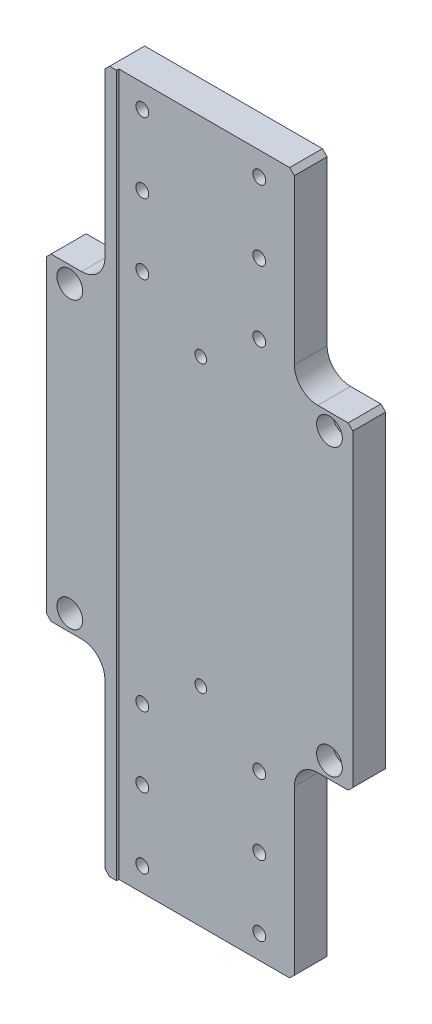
ISO-10303-21;
HEADER;
FILE_DESCRIPTION(('STEP AP214'),'2;1');
FILE_NAME('part.step','',(''),(''),'','','');
FILE_SCHEMA(('AUTOMOTIVE_DESIGN { 1 0 10303 214 1 1 1 1 }'));
ENDSEC;
DATA;
#1=APPLICATION_CONTEXT('core data for automotive mechanical design processes');
#2=APPLICATION_PROTOCOL_DEFINITION('international standard','automotive_design',2000,#1);
#3=PRODUCT_CONTEXT('',#1,'mechanical');
#4=PRODUCT('Part','Part','',(#3));
#5=PRODUCT_RELATED_PRODUCT_CATEGORY('part','',(#4));
#6=PRODUCT_DEFINITION_FORMATION('','',#4);
#7=PRODUCT_DEFINITION_CONTEXT('part definition',#1,'design');
#8=PRODUCT_DEFINITION('design','',#6,#7);
#9=PRODUCT_DEFINITION_SHAPE('','',#8);
#10=(LENGTH_UNIT() NAMED_UNIT(*) SI_UNIT(.MILLI.,.METRE.));
#11=(NAMED_UNIT(*) PLANE_ANGLE_UNIT() SI_UNIT($,.RADIAN.));
#12=(NAMED_UNIT(*) SI_UNIT($,.STERADIAN.) SOLID_ANGLE_UNIT());
#13=UNCERTAINTY_MEASURE_WITH_UNIT(LENGTH_MEASURE(1.E-05),#10,'distance_accuracy_value','');
#14=(GEOMETRIC_REPRESENTATION_CONTEXT(3) GLOBAL_UNCERTAINTY_ASSIGNED_CONTEXT((#13)) GLOBAL_UNIT_ASSIGNED_CONTEXT((#10,
#11,#12)) REPRESENTATION_CONTEXT('',''));
#15=CARTESIAN_POINT('',(0.,0.,0.));
#16=DIRECTION('',(0.,0.,1.));
#17=DIRECTION('',(1.,0.,0.));
#18=AXIS2_PLACEMENT_3D('',#15,#16,#17);
#19=CARTESIAN_POINT('',(0.,0.,-7.5));
#20=DIRECTION('',(0.,0.,1.));
#21=DIRECTION('',(1.,0.,0.));
#22=AXIS2_PLACEMENT_3D('',#19,#20,#21);
#23=PLANE('',#22);
#24=CARTESIAN_POINT('',(-55.,60.9999999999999,-7.5));
#25=DIRECTION('',(0.,0.,1.));
#26=DIRECTION('',(1.,0.,0.));
#27=AXIS2_PLACEMENT_3D('',#24,#25,#26);
#28=CIRCLE('',#27,3.3);
#29=CARTESIAN_POINT('',(-51.7,60.9999999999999,-7.5));
#30=VERTEX_POINT('',#29);
#31=EDGE_CURVE('E1303',#30,#30,#28,.T.);
#32=ORIENTED_EDGE('',*,*,#31,.T.);
#33=EDGE_LOOP('',(#32));
#34=FACE_BOUND('',#33,.T.);
#35=CARTESIAN_POINT('',(-55.,-61.0000000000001,-7.5));
#36=DIRECTION('',(0.,0.,1.));
#37=DIRECTION('',(1.,0.,0.));
#38=AXIS2_PLACEMENT_3D('',#35,#36,#37);
#39=CIRCLE('',#38,3.3);
#40=CARTESIAN_POINT('',(-51.7,-61.0000000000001,-7.5));
#41=VERTEX_POINT('',#40);
#42=EDGE_CURVE('E1318',#41,#41,#39,.T.);
#43=ORIENTED_EDGE('',*,*,#42,.T.);
#44=EDGE_LOOP('',(#43));
#45=FACE_BOUND('',#44,.T.);
#46=CARTESIAN_POINT('',(55.,60.9999999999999,-7.5));
#47=DIRECTION('',(0.,0.,1.));
#48=DIRECTION('',(1.,0.,0.));
#49=AXIS2_PLACEMENT_3D('',#46,#47,#48);
#50=CIRCLE('',#49,3.3);
#51=CARTESIAN_POINT('',(58.3,60.9999999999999,-7.5));
#52=VERTEX_POINT('',#51);
#53=EDGE_CURVE('E341',#52,#52,#50,.T.);
#54=ORIENTED_EDGE('',*,*,#53,.T.);
#55=EDGE_LOOP('',(#54));
#56=FACE_BOUND('',#55,.T.);
#57=CARTESIAN_POINT('',(55.,-61.0000000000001,-7.5));
#58=DIRECTION('',(0.,0.,1.));
#59=DIRECTION('',(1.,0.,0.));
#60=AXIS2_PLACEMENT_3D('',#57,#58,#59);
#61=CIRCLE('',#60,3.3);
#62=CARTESIAN_POINT('',(58.3,-61.0000000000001,-7.5));
#63=VERTEX_POINT('',#62);
#64=EDGE_CURVE('E336',#63,#63,#61,.T.);
#65=ORIENTED_EDGE('',*,*,#64,.T.);
#66=EDGE_LOOP('',(#65));
#67=FACE_BOUND('',#66,.T.);
#68=CARTESIAN_POINT('',(-25.,-80.0000000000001,-7.5));
#69=DIRECTION('',(0.,0.,-1.));
#70=DIRECTION('',(-1.,0.,0.));
#71=AXIS2_PLACEMENT_3D('',#68,#69,#70);
#72=CIRCLE('',#71,4.75);
#73=CARTESIAN_POINT('',(-29.75,-80.0000000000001,-7.5));
#74=VERTEX_POINT('',#73);
#75=EDGE_CURVE('E335',#74,#74,#72,.T.);
#76=ORIENTED_EDGE('',*,*,#75,.F.);
#77=EDGE_LOOP('',(#76));
#78=FACE_BOUND('',#77,.T.);
#79=CARTESIAN_POINT('',(25.,-110.,-7.5));
#80=DIRECTION('',(0.,0.,-1.));
#81=DIRECTION('',(-1.,0.,0.));
#82=AXIS2_PLACEMENT_3D('',#79,#80,#81);
#83=CIRCLE('',#82,4.75);
#84=CARTESIAN_POINT('',(20.25,-110.,-7.5));
#85=VERTEX_POINT('',#84);
#86=EDGE_CURVE('E1347',#85,#85,#83,.T.);
#87=ORIENTED_EDGE('',*,*,#86,.F.);
#88=EDGE_LOOP('',(#87));
#89=FACE_BOUND('',#88,.T.);
#90=CARTESIAN_POINT('',(-25.,-110.,-7.5));
#91=DIRECTION('',(0.,0.,-1.));
#92=DIRECTION('',(-1.,0.,0.));
#93=AXIS2_PLACEMENT_3D('',#90,#91,#92);
#94=CIRCLE('',#93,4.75);
#95=CARTESIAN_POINT('',(-29.75,-110.,-7.5));
#96=VERTEX_POINT('',#95);
#97=EDGE_CURVE('E1359',#96,#96,#94,.T.);
#98=ORIENTED_EDGE('',*,*,#97,.F.);
#99=EDGE_LOOP('',(#98));
#100=FACE_BOUND('',#99,.T.);
#101=CARTESIAN_POINT('',(25.,-140.,-7.5));
#102=DIRECTION('',(0.,0.,-1.));
#103=DIRECTION('',(-1.,0.,0.));
#104=AXIS2_PLACEMENT_3D('',#101,#102,#103);
#105=CIRCLE('',#104,4.75);
#106=CARTESIAN_POINT('',(20.25,-140.,-7.5));
#107=VERTEX_POINT('',#106);
#108=EDGE_CURVE('E1371',#107,#107,#105,.T.);
#109=ORIENTED_EDGE('',*,*,#108,.F.);
#110=EDGE_LOOP('',(#109));
#111=FACE_BOUND('',#110,.T.);
#112=CARTESIAN_POINT('',(-25.,-140.,-7.5));
#113=DIRECTION('',(0.,0.,-1.));
#114=DIRECTION('',(-1.,0.,0.));
#115=AXIS2_PLACEMENT_3D('',#112,#113,#114);
#116=CIRCLE('',#115,4.75);
#117=CARTESIAN_POINT('',(-29.75,-140.,-7.5));
#118=VERTEX_POINT('',#117);
#119=EDGE_CURVE('E1383',#118,#118,#116,.T.);
#120=ORIENTED_EDGE('',*,*,#119,.F.);
#121=EDGE_LOOP('',(#120));
#122=FACE_BOUND('',#121,.T.);
#123=CARTESIAN_POINT('',(25.,-80.0000000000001,-7.5));
#124=DIRECTION('',(0.,0.,-1.));
#125=DIRECTION('',(-1.,0.,0.));
#126=AXIS2_PLACEMENT_3D('',#123,#124,#125);
#127=CIRCLE('',#126,4.75);
#128=CARTESIAN_POINT('',(20.25,-80.0000000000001,-7.5));
#129=VERTEX_POINT('',#128);
#130=EDGE_CURVE('E1395',#129,#129,#127,.T.);
#131=ORIENTED_EDGE('',*,*,#130,.F.);
#132=EDGE_LOOP('',(#131));
#133=FACE_BOUND('',#132,.T.);
#134=CARTESIAN_POINT('',(25.,140.,-7.5));
#135=DIRECTION('',(0.,0.,-1.));
#136=DIRECTION('',(-1.,0.,0.));
#137=AXIS2_PLACEMENT_3D('',#134,#135,#136);
#138=CIRCLE('',#137,4.75);
#139=CARTESIAN_POINT('',(20.25,140.,-7.5));
#140=VERTEX_POINT('',#139);
#141=EDGE_CURVE('E1407',#140,#140,#138,.T.);
#142=ORIENTED_EDGE('',*,*,#141,.F.);
#143=EDGE_LOOP('',(#142));
#144=FACE_BOUND('',#143,.T.);
#145=CARTESIAN_POINT('',(-25.,140.,-7.5));
#146=DIRECTION('',(0.,0.,-1.));
#147=DIRECTION('',(-1.,0.,0.));
#148=AXIS2_PLACEMENT_3D('',#145,#146,#147);
#149=CIRCLE('',#148,4.75);
#150=CARTESIAN_POINT('',(-29.75,140.,-7.5));
#151=VERTEX_POINT('',#150);
#152=EDGE_CURVE('E330',#151,#151,#149,.T.);
#153=ORIENTED_EDGE('',*,*,#152,.F.);
#154=EDGE_LOOP('',(#153));
#155=FACE_BOUND('',#154,.T.);
#156=CARTESIAN_POINT('',(25.,110.,-7.5));
#157=DIRECTION('',(0.,0.,-1.));
#158=DIRECTION('',(-1.,0.,0.));
#159=AXIS2_PLACEMENT_3D('',#156,#157,#158);
#160=CIRCLE('',#159,4.75);
#161=CARTESIAN_POINT('',(20.25,110.,-7.5));
#162=VERTEX_POINT('',#161);
#163=EDGE_CURVE('E325',#162,#162,#160,.T.);
#164=ORIENTED_EDGE('',*,*,#163,.F.);
#165=EDGE_LOOP('',(#164));
#166=FACE_BOUND('',#165,.T.);
#167=CARTESIAN_POINT('',(-25.,110.,-7.5));
#168=DIRECTION('',(0.,0.,-1.));
#169=DIRECTION('',(-1.,0.,0.));
#170=AXIS2_PLACEMENT_3D('',#167,#168,#169);
#171=CIRCLE('',#170,4.75);
#172=CARTESIAN_POINT('',(-29.75,110.,-7.5));
#173=VERTEX_POINT('',#172);
#174=EDGE_CURVE('E320',#173,#173,#171,.T.);
#175=ORIENTED_EDGE('',*,*,#174,.F.);
#176=EDGE_LOOP('',(#175));
#177=FACE_BOUND('',#176,.T.);
#178=CARTESIAN_POINT('',(-25.,79.9999999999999,-7.5));
#179=DIRECTION('',(0.,0.,-1.));
#180=DIRECTION('',(-1.,0.,0.));
#181=AXIS2_PLACEMENT_3D('',#178,#179,#180);
#182=CIRCLE('',#181,4.75);
#183=CARTESIAN_POINT('',(-29.75,79.9999999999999,-7.5));
#184=VERTEX_POINT('',#183);
#185=EDGE_CURVE('E310',#184,#184,#182,.T.);
#186=ORIENTED_EDGE('',*,*,#185,.F.);
#187=EDGE_LOOP('',(#186));
#188=FACE_BOUND('',#187,.T.);
#189=CARTESIAN_POINT('',(0.,60.9999999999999,-7.5));
#190=DIRECTION('',(0.,0.,1.));
#191=DIRECTION('',(1.,0.,0.));
#192=AXIS2_PLACEMENT_3D('',#189,#190,#191);
#193=CIRCLE('',#192,2.5);
#194=CARTESIAN_POINT('',(2.5,60.9999999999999,-7.5));
#195=VERTEX_POINT('',#194);
#196=EDGE_CURVE('E1452',#195,#195,#193,.T.);
#197=ORIENTED_EDGE('',*,*,#196,.T.);
#198=EDGE_LOOP('',(#197));
#199=FACE_BOUND('',#198,.T.);
#200=CARTESIAN_POINT('',(0.,-61.0000000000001,-7.5));
#201=DIRECTION('',(0.,0.,1.));
#202=DIRECTION('',(1.,0.,0.));
#203=AXIS2_PLACEMENT_3D('',#200,#201,#202);
#204=CIRCLE('',#203,2.5);
#205=CARTESIAN_POINT('',(2.5,-61.0000000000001,-7.5));
#206=VERTEX_POINT('',#205);
#207=EDGE_CURVE('E242',#206,#206,#204,.T.);
#208=ORIENTED_EDGE('',*,*,#207,.T.);
#209=EDGE_LOOP('',(#208));
#210=FACE_BOUND('',#209,.T.);
#211=DIRECTION('',(0.,-1.,0.));
#212=VECTOR('',#211,1.);
#213=CARTESIAN_POINT('',(-40.,0.,-7.5));
#214=LINE('',#213,#212);
#215=CARTESIAN_POINT('',(-40.,148.,-7.5));
#216=VERTEX_POINT('',#215);
#217=CARTESIAN_POINT('',(-40.,77.9999999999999,-7.5));
#218=VERTEX_POINT('',#217);
#219=EDGE_CURVE('E275',#216,#218,#214,.T.);
#220=ORIENTED_EDGE('',*,*,#219,.F.);
#221=DIRECTION('',(0.707106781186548,0.707106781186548,0.));
#222=VECTOR('',#221,1.);
#223=CARTESIAN_POINT('',(-40.,148.,-7.5));
#224=LINE('',#223,#222);
#225=CARTESIAN_POINT('',(-37.9999999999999,150.,-7.5));
#226=VERTEX_POINT('',#225);
#227=EDGE_CURVE('E400',#216,#226,#224,.T.);
#228=ORIENTED_EDGE('',*,*,#227,.T.);
#229=DIRECTION('',(1.,0.,0.));
#230=VECTOR('',#229,1.);
#231=CARTESIAN_POINT('',(0.,150.,-7.5));
#232=LINE('',#231,#230);
#233=CARTESIAN_POINT('',(38.0000000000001,150.,-7.5));
#234=VERTEX_POINT('',#233);
#235=EDGE_CURVE('E272',#226,#234,#232,.T.);
#236=ORIENTED_EDGE('',*,*,#235,.T.);
#237=DIRECTION('',(-0.707106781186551,0.707106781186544,0.));
#238=VECTOR('',#237,1.);
#239=CARTESIAN_POINT('',(38.0000000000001,150.,-7.5));
#240=LINE('',#239,#238);
#241=CARTESIAN_POINT('',(40.,148.,-7.5));
#242=VERTEX_POINT('',#241);
#243=EDGE_CURVE('E388',#234,#242,#240,.F.);
#244=ORIENTED_EDGE('',*,*,#243,.T.);
#245=DIRECTION('',(0.,-1.,0.));
#246=VECTOR('',#245,1.);
#247=CARTESIAN_POINT('',(40.,0.,-7.5));
#248=LINE('',#247,#246);
#249=CARTESIAN_POINT('',(40.,77.9999999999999,-7.5));
#250=VERTEX_POINT('',#249);
#251=EDGE_CURVE('E252',#242,#250,#248,.T.);
#252=ORIENTED_EDGE('',*,*,#251,.T.);
#253=CARTESIAN_POINT('',(50.,77.9999999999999,-7.5));
#254=DIRECTION('',(0.,0.,1.));
#255=DIRECTION('',(1.,0.,0.));
#256=AXIS2_PLACEMENT_3D('',#253,#254,#255);
#257=CIRCLE('',#256,10.);
#258=CARTESIAN_POINT('',(50.,67.9999999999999,-7.5));
#259=VERTEX_POINT('',#258);
#260=EDGE_CURVE('E369',#250,#259,#257,.T.);
#261=ORIENTED_EDGE('',*,*,#260,.T.);
#262=DIRECTION('',(1.,0.,0.));
#263=VECTOR('',#262,1.);
#264=CARTESIAN_POINT('',(0.,67.9999999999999,-7.5));
#265=LINE('',#264,#263);
#266=CARTESIAN_POINT('',(63.,67.9999999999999,-7.5));
#267=VERTEX_POINT('',#266);
#268=EDGE_CURVE('E256',#259,#267,#265,.T.);
#269=ORIENTED_EDGE('',*,*,#268,.T.);
#270=DIRECTION('',(-0.707106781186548,0.707106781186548,0.));
#271=VECTOR('',#270,1.);
#272=CARTESIAN_POINT('',(63.,67.9999999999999,-7.5));
#273=LINE('',#272,#271);
#274=CARTESIAN_POINT('',(65.,65.9999999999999,-7.5));
#275=VERTEX_POINT('',#274);
#276=EDGE_CURVE('E386',#267,#275,#273,.F.);
#277=ORIENTED_EDGE('',*,*,#276,.T.);
#278=DIRECTION('',(0.,-1.,0.));
#279=VECTOR('',#278,1.);
#280=CARTESIAN_POINT('',(65.,0.,-7.5));
#281=LINE('',#280,#279);
#282=CARTESIAN_POINT('',(65.,-66.0000000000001,-7.5));
#283=VERTEX_POINT('',#282);
#284=EDGE_CURVE('E295',#275,#283,#281,.T.);
#285=ORIENTED_EDGE('',*,*,#284,.T.);
#286=DIRECTION('',(-0.707106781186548,-0.707106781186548,0.));
#287=VECTOR('',#286,1.);
#288=CARTESIAN_POINT('',(65.,-66.0000000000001,-7.5));
#289=LINE('',#288,#287);
#290=CARTESIAN_POINT('',(63.,-68.0000000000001,-7.5));
#291=VERTEX_POINT('',#290);
#292=EDGE_CURVE('E390',#283,#291,#289,.T.);
#293=ORIENTED_EDGE('',*,*,#292,.T.);
#294=DIRECTION('',(1.,0.,0.));
#295=VECTOR('',#294,1.);
#296=CARTESIAN_POINT('',(0.,-68.0000000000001,-7.5));
#297=LINE('',#296,#295);
#298=CARTESIAN_POINT('',(50.,-68.0000000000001,-7.5));
#299=VERTEX_POINT('',#298);
#300=EDGE_CURVE('E292',#299,#291,#297,.T.);
#301=ORIENTED_EDGE('',*,*,#300,.F.);
#302=CARTESIAN_POINT('',(50.,-78.0000000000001,-7.5));
#303=DIRECTION('',(0.,0.,1.));
#304=DIRECTION('',(1.,0.,0.));
#305=AXIS2_PLACEMENT_3D('',#302,#303,#304);
#306=CIRCLE('',#305,10.);
#307=CARTESIAN_POINT('',(40.,-78.0000000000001,-7.5));
#308=VERTEX_POINT('',#307);
#309=EDGE_CURVE('E374',#299,#308,#306,.T.);
#310=ORIENTED_EDGE('',*,*,#309,.T.);
#311=DIRECTION('',(0.,-1.,0.));
#312=VECTOR('',#311,1.);
#313=CARTESIAN_POINT('',(40.,0.,-7.5));
#314=LINE('',#313,#312);
#315=CARTESIAN_POINT('',(40.,-148.,-7.5));
#316=VERTEX_POINT('',#315);
#317=EDGE_CURVE('E289',#308,#316,#314,.T.);
#318=ORIENTED_EDGE('',*,*,#317,.T.);
#319=DIRECTION('',(-0.707106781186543,-0.707106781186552,0.));
#320=VECTOR('',#319,1.);
#321=CARTESIAN_POINT('',(40.,-148.,-7.5));
#322=LINE('',#321,#320);
#323=CARTESIAN_POINT('',(38.0000000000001,-150.,-7.5));
#324=VERTEX_POINT('',#323);
#325=EDGE_CURVE('E392',#316,#324,#322,.T.);
#326=ORIENTED_EDGE('',*,*,#325,.T.);
#327=DIRECTION('',(1.,0.,0.));
#328=VECTOR('',#327,1.);
#329=CARTESIAN_POINT('',(0.,-150.,-7.5));
#330=LINE('',#329,#328);
#331=CARTESIAN_POINT('',(-38.,-150.,-7.5));
#332=VERTEX_POINT('',#331);
#333=EDGE_CURVE('E287',#332,#324,#330,.T.);
#334=ORIENTED_EDGE('',*,*,#333,.F.);
#335=DIRECTION('',(0.707106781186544,-0.707106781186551,0.));
#336=VECTOR('',#335,1.);
#337=CARTESIAN_POINT('',(-38.,-150.,-7.5));
#338=LINE('',#337,#336);
#339=CARTESIAN_POINT('',(-40.,-148.,-7.5));
#340=VERTEX_POINT('',#339);
#341=EDGE_CURVE('E396',#332,#340,#338,.F.);
#342=ORIENTED_EDGE('',*,*,#341,.T.);
#343=DIRECTION('',(0.,-1.,0.));
#344=VECTOR('',#343,1.);
#345=CARTESIAN_POINT('',(-40.,0.,-7.5));
#346=LINE('',#345,#344);
#347=CARTESIAN_POINT('',(-40.,-78.0000000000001,-7.5));
#348=VERTEX_POINT('',#347);
#349=EDGE_CURVE('E284',#348,#340,#346,.T.);
#350=ORIENTED_EDGE('',*,*,#349,.F.);
#351=CARTESIAN_POINT('',(-50.,-78.0000000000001,-7.5));
#352=DIRECTION('',(0.,0.,1.));
#353=DIRECTION('',(1.,0.,0.));
#354=AXIS2_PLACEMENT_3D('',#351,#352,#353);
#355=CIRCLE('',#354,10.);
#356=CARTESIAN_POINT('',(-50.,-68.0000000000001,-7.5));
#357=VERTEX_POINT('',#356);
#358=EDGE_CURVE('E378',#348,#357,#355,.T.);
#359=ORIENTED_EDGE('',*,*,#358,.T.);
#360=DIRECTION('',(1.,0.,0.));
#361=VECTOR('',#360,1.);
#362=CARTESIAN_POINT('',(0.,-68.0000000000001,-7.5));
#363=LINE('',#362,#361);
#364=CARTESIAN_POINT('',(-62.9999999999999,-68.0000000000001,-7.5));
#365=VERTEX_POINT('',#364);
#366=EDGE_CURVE('E282',#365,#357,#363,.T.);
#367=ORIENTED_EDGE('',*,*,#366,.F.);
#368=DIRECTION('',(0.70710678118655,-0.707106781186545,0.));
#369=VECTOR('',#368,1.);
#370=CARTESIAN_POINT('',(-62.9999999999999,-68.0000000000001,-7.5));
#371=LINE('',#370,#369);
#372=CARTESIAN_POINT('',(-65.,-66.,-7.5));
#373=VERTEX_POINT('',#372);
#374=EDGE_CURVE('E394',#365,#373,#371,.F.);
#375=ORIENTED_EDGE('',*,*,#374,.T.);
#376=DIRECTION('',(0.,-1.,0.));
#377=VECTOR('',#376,1.);
#378=CARTESIAN_POINT('',(-65.,0.,-7.5));
#379=LINE('',#378,#377);
#380=CARTESIAN_POINT('',(-65.,65.9999999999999,-7.5));
#381=VERTEX_POINT('',#380);
#382=EDGE_CURVE('E279',#381,#373,#379,.T.);
#383=ORIENTED_EDGE('',*,*,#382,.F.);
#384=DIRECTION('',(0.707106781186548,0.707106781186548,0.));
#385=VECTOR('',#384,1.);
#386=CARTESIAN_POINT('',(-65.,65.9999999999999,-7.5));
#387=LINE('',#386,#385);
#388=CARTESIAN_POINT('',(-63.,67.9999999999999,-7.5));
#389=VERTEX_POINT('',#388);
#390=EDGE_CURVE('E398',#381,#389,#387,.T.);
#391=ORIENTED_EDGE('',*,*,#390,.T.);
#392=DIRECTION('',(1.,0.,0.));
#393=VECTOR('',#392,1.);
#394=CARTESIAN_POINT('',(0.,67.9999999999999,-7.5));
#395=LINE('',#394,#393);
#396=CARTESIAN_POINT('',(-50.,67.9999999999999,-7.5));
#397=VERTEX_POINT('',#396);
#398=EDGE_CURVE('E277',#389,#397,#395,.T.);
#399=ORIENTED_EDGE('',*,*,#398,.T.);
#400=CARTESIAN_POINT('',(-50.,77.9999999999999,-7.5));
#401=DIRECTION('',(0.,0.,1.));
#402=DIRECTION('',(1.,0.,0.));
#403=AXIS2_PLACEMENT_3D('',#400,#401,#402);
#404=CIRCLE('',#403,10.);
#405=EDGE_CURVE('E363',#397,#218,#404,.T.);
#406=ORIENTED_EDGE('',*,*,#405,.T.);
#407=EDGE_LOOP('',(#220,#228,#236,#244,#252,#261,#269,#277,#285,#293,#301,#310,#318,#326,#334,
#342,#350,#359,#367,#375,#383,#391,#399,#406));
#408=FACE_BOUND('',#407,.T.);
#409=CARTESIAN_POINT('',(25.,79.9999999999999,-7.5));
#410=DIRECTION('',(0.,0.,-1.));
#411=DIRECTION('',(-1.,0.,0.));
#412=AXIS2_PLACEMENT_3D('',#409,#410,#411);
#413=CIRCLE('',#412,4.75);
#414=CARTESIAN_POINT('',(20.25,79.9999999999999,-7.5));
#415=VERTEX_POINT('',#414);
#416=EDGE_CURVE('E315',#415,#415,#413,.T.);
#417=ORIENTED_EDGE('',*,*,#416,.F.);
#418=EDGE_LOOP('',(#417));
#419=FACE_BOUND('',#418,.T.);
#420=ADVANCED_FACE('F35',(#34,#45,#56,#67,#78,#89,#100,#111,#122,#133,#144,#155,#166,#177,#188,
#199,#210,#408,#419),#23,.F.);
#421=CARTESIAN_POINT('',(40.,0.,7.5));
#422=DIRECTION('',(1.,0.,0.));
#423=DIRECTION('',(0.,1.,0.));
#424=AXIS2_PLACEMENT_3D('',#421,#422,#423);
#425=PLANE('',#424);
#426=ORIENTED_EDGE('',*,*,#251,.F.);
#427=DIRECTION('',(0.,0.,1.));
#428=VECTOR('',#427,1.);
#429=CARTESIAN_POINT('',(40.,148.,7.5));
#430=LINE('',#429,#428);
#431=CARTESIAN_POINT('',(40.,148.,6.5));
#432=VERTEX_POINT('',#431);
#433=EDGE_CURVE('E43',#242,#432,#430,.T.);
#434=ORIENTED_EDGE('',*,*,#433,.T.);
#435=DIRECTION('',(0.,-1.,0.));
#436=VECTOR('',#435,1.);
#437=CARTESIAN_POINT('',(40.,0.,6.5));
#438=LINE('',#437,#436);
#439=CARTESIAN_POINT('',(40.,77.9999999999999,6.5));
#440=VERTEX_POINT('',#439);
#441=EDGE_CURVE('E243',#432,#440,#438,.T.);
#442=ORIENTED_EDGE('',*,*,#441,.T.);
#443=DIRECTION('',(0.,0.,-1.));
#444=VECTOR('',#443,1.);
#445=CARTESIAN_POINT('',(40.,77.9999999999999,-7.5));
#446=LINE('',#445,#444);
#447=EDGE_CURVE('E347',#440,#250,#446,.T.);
#448=ORIENTED_EDGE('',*,*,#447,.T.);
#449=EDGE_LOOP('',(#426,#434,#442,#448));
#450=FACE_BOUND('',#449,.T.);
#451=ADVANCED_FACE('F478',(#450),#425,.T.);
#452=CARTESIAN_POINT('',(40.,0.,7.5));
#453=DIRECTION('',(1.,0.,0.));
#454=DIRECTION('',(0.,1.,0.));
#455=AXIS2_PLACEMENT_3D('',#452,#453,#454);
#456=PLANE('',#455);
#457=DIRECTION('',(0.,-1.,0.));
#458=VECTOR('',#457,1.);
#459=CARTESIAN_POINT('',(40.,0.,6.5));
#460=LINE('',#459,#458);
#461=CARTESIAN_POINT('',(40.,-78.0000000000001,6.5));
#462=VERTEX_POINT('',#461);
#463=CARTESIAN_POINT('',(40.,-148.,6.5));
#464=VERTEX_POINT('',#463);
#465=EDGE_CURVE('E249',#462,#464,#460,.T.);
#466=ORIENTED_EDGE('',*,*,#465,.T.);
#467=DIRECTION('',(0.,0.,-1.));
#468=VECTOR('',#467,1.);
#469=CARTESIAN_POINT('',(40.,-148.,-7.5));
#470=LINE('',#469,#468);
#471=EDGE_CURVE('E431',#464,#316,#470,.T.);
#472=ORIENTED_EDGE('',*,*,#471,.T.);
#473=ORIENTED_EDGE('',*,*,#317,.F.);
#474=DIRECTION('',(0.,0.,-1.));
#475=VECTOR('',#474,1.);
#476=CARTESIAN_POINT('',(40.,-78.0000000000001,7.5));
#477=LINE('',#476,#475);
#478=EDGE_CURVE('E355',#308,#462,#477,.F.);
#479=ORIENTED_EDGE('',*,*,#478,.T.);
#480=EDGE_LOOP('',(#466,#472,#473,#479));
#481=FACE_BOUND('',#480,.T.);
#482=ADVANCED_FACE('F559',(#481),#456,.T.);
#483=CARTESIAN_POINT('',(0.,-68.0000000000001,7.5));
#484=DIRECTION('',(0.,1.,0.));
#485=DIRECTION('',(0.,0.,1.));
#486=AXIS2_PLACEMENT_3D('',#483,#484,#485);
#487=PLANE('',#486);
#488=ORIENTED_EDGE('',*,*,#300,.T.);
#489=DIRECTION('',(0.,0.,1.));
#490=VECTOR('',#489,1.);
#491=CARTESIAN_POINT('',(63.,-68.0000000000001,6.5));
#492=LINE('',#491,#490);
#493=CARTESIAN_POINT('',(63.,-68.0000000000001,6.5));
#494=VERTEX_POINT('',#493);
#495=EDGE_CURVE('E446',#291,#494,#492,.T.);
#496=ORIENTED_EDGE('',*,*,#495,.T.);
#497=DIRECTION('',(1.,0.,0.));
#498=VECTOR('',#497,1.);
#499=CARTESIAN_POINT('',(0.,-68.0000000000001,6.5));
#500=LINE('',#499,#498);
#501=CARTESIAN_POINT('',(50.,-68.0000000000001,6.5));
#502=VERTEX_POINT('',#501);
#503=EDGE_CURVE('E246',#502,#494,#500,.T.);
#504=ORIENTED_EDGE('',*,*,#503,.F.);
#505=DIRECTION('',(0.,0.,-1.));
#506=VECTOR('',#505,1.);
#507=CARTESIAN_POINT('',(50.,-68.0000000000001,7.5));
#508=LINE('',#507,#506);
#509=EDGE_CURVE('E352',#502,#299,#508,.T.);
#510=ORIENTED_EDGE('',*,*,#509,.T.);
#511=EDGE_LOOP('',(#488,#496,#504,#510));
#512=FACE_BOUND('',#511,.T.);
#513=ADVANCED_FACE('F450',(#512),#487,.F.);
#514=CARTESIAN_POINT('',(65.,0.,7.5));
#515=DIRECTION('',(1.,0.,0.));
#516=DIRECTION('',(0.,0.,-1.));
#517=AXIS2_PLACEMENT_3D('',#514,#515,#516);
#518=PLANE('',#517);
#519=DIRECTION('',(0.,1.,0.));
#520=VECTOR('',#519,1.);
#521=CARTESIAN_POINT('',(65.,150.,6.5));
#522=LINE('',#521,#520);
#523=CARTESIAN_POINT('',(65.,-66.0000000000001,6.5));
#524=VERTEX_POINT('',#523);
#525=CARTESIAN_POINT('',(65.,65.9999999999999,6.5));
#526=VERTEX_POINT('',#525);
#527=EDGE_CURVE('E235',#524,#526,#522,.T.);
#528=ORIENTED_EDGE('',*,*,#527,.F.);
#529=DIRECTION('',(0.,0.,-1.));
#530=VECTOR('',#529,1.);
#531=CARTESIAN_POINT('',(65.,-66.0000000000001,-7.5));
#532=LINE('',#531,#530);
#533=EDGE_CURVE('E443',#524,#283,#532,.T.);
#534=ORIENTED_EDGE('',*,*,#533,.T.);
#535=ORIENTED_EDGE('',*,*,#284,.F.);
#536=DIRECTION('',(0.,0.,1.));
#537=VECTOR('',#536,1.);
#538=CARTESIAN_POINT('',(65.,65.9999999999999,7.5));
#539=LINE('',#538,#537);
#540=EDGE_CURVE('E441',#275,#526,#539,.T.);
#541=ORIENTED_EDGE('',*,*,#540,.T.);
#542=EDGE_LOOP('',(#528,#534,#535,#541));
#543=FACE_BOUND('',#542,.T.);
#544=ADVANCED_FACE('F462',(#543),#518,.T.);
#545=CARTESIAN_POINT('',(0.,67.9999999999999,7.5));
#546=DIRECTION('',(0.,1.,0.));
#547=DIRECTION('',(0.,0.,1.));
#548=AXIS2_PLACEMENT_3D('',#545,#546,#547);
#549=PLANE('',#548);
#550=DIRECTION('',(1.,0.,0.));
#551=VECTOR('',#550,1.);
#552=CARTESIAN_POINT('',(0.,67.9999999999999,6.5));
#553=LINE('',#552,#551);
#554=CARTESIAN_POINT('',(50.,67.9999999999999,6.5));
#555=VERTEX_POINT('',#554);
#556=CARTESIAN_POINT('',(63.,67.9999999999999,6.5));
#557=VERTEX_POINT('',#556);
#558=EDGE_CURVE('E270',#555,#557,#553,.T.);
#559=ORIENTED_EDGE('',*,*,#558,.T.);
#560=DIRECTION('',(0.,0.,-1.));
#561=VECTOR('',#560,1.);
#562=CARTESIAN_POINT('',(63.,67.9999999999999,7.5));
#563=LINE('',#562,#561);
#564=EDGE_CURVE('E11',#557,#267,#563,.T.);
#565=ORIENTED_EDGE('',*,*,#564,.T.);
#566=ORIENTED_EDGE('',*,*,#268,.F.);
#567=DIRECTION('',(0.,0.,-1.));
#568=VECTOR('',#567,1.);
#569=CARTESIAN_POINT('',(50.,67.9999999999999,6.5));
#570=LINE('',#569,#568);
#571=EDGE_CURVE('E350',#259,#555,#570,.F.);
#572=ORIENTED_EDGE('',*,*,#571,.T.);
#573=EDGE_LOOP('',(#559,#565,#566,#572));
#574=FACE_BOUND('',#573,.T.);
#575=ADVANCED_FACE('F471',(#574),#549,.T.);
#576=CARTESIAN_POINT('',(0.,150.,7.5));
#577=DIRECTION('',(0.,1.,0.));
#578=DIRECTION('',(-1.,0.,0.));
#579=AXIS2_PLACEMENT_3D('',#576,#577,#578);
#580=PLANE('',#579);
#581=ORIENTED_EDGE('',*,*,#235,.F.);
#582=DIRECTION('',(0.,0.,1.));
#583=VECTOR('',#582,1.);
#584=CARTESIAN_POINT('',(-37.9999999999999,150.,7.5));
#585=LINE('',#584,#583);
#586=CARTESIAN_POINT('',(-37.9999999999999,150.,7.5));
#587=VERTEX_POINT('',#586);
#588=EDGE_CURVE('E405',#226,#587,#585,.T.);
#589=ORIENTED_EDGE('',*,*,#588,.T.);
#590=DIRECTION('',(1.,0.,0.));
#591=VECTOR('',#590,1.);
#592=CARTESIAN_POINT('',(0.,150.,7.5));
#593=LINE('',#592,#591);
#594=CARTESIAN_POINT('',(-35.,150.,7.5));
#595=VERTEX_POINT('',#594);
#596=EDGE_CURVE('E253',#587,#595,#593,.T.);
#597=ORIENTED_EDGE('',*,*,#596,.T.);
#598=DIRECTION('',(0.,0.,1.));
#599=VECTOR('',#598,1.);
#600=CARTESIAN_POINT('',(-35.,150.,6.5));
#601=LINE('',#600,#599);
#602=CARTESIAN_POINT('',(-35.,150.,6.5));
#603=VERTEX_POINT('',#602);
#604=EDGE_CURVE('E222',#603,#595,#601,.T.);
#605=ORIENTED_EDGE('',*,*,#604,.F.);
#606=DIRECTION('',(-1.,0.,0.));
#607=VECTOR('',#606,1.);
#608=CARTESIAN_POINT('',(-35.,150.,6.5));
#609=LINE('',#608,#607);
#610=CARTESIAN_POINT('',(38.0000000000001,150.,6.5));
#611=VERTEX_POINT('',#610);
#612=EDGE_CURVE('E223',#611,#603,#609,.T.);
#613=ORIENTED_EDGE('',*,*,#612,.F.);
#614=DIRECTION('',(0.,0.,-1.));
#615=VECTOR('',#614,1.);
#616=CARTESIAN_POINT('',(38.0000000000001,150.,7.5));
#617=LINE('',#616,#615);
#618=EDGE_CURVE('E402',#611,#234,#617,.T.);
#619=ORIENTED_EDGE('',*,*,#618,.T.);
#620=EDGE_LOOP('',(#581,#589,#597,#605,#613,#619));
#621=FACE_BOUND('',#620,.T.);
#622=ADVANCED_FACE('F485',(#621),#580,.T.);
#623=CARTESIAN_POINT('',(-40.,0.,7.5));
#624=DIRECTION('',(1.,0.,0.));
#625=DIRECTION('',(0.,1.,0.));
#626=AXIS2_PLACEMENT_3D('',#623,#624,#625);
#627=PLANE('',#626);
#628=DIRECTION('',(0.,-1.,0.));
#629=VECTOR('',#628,1.);
#630=CARTESIAN_POINT('',(-40.,0.,7.5));
#631=LINE('',#630,#629);
#632=CARTESIAN_POINT('',(-40.,148.,7.5));
#633=VERTEX_POINT('',#632);
#634=CARTESIAN_POINT('',(-40.,77.9999999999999,7.5));
#635=VERTEX_POINT('',#634);
#636=EDGE_CURVE('E255',#633,#635,#631,.T.);
#637=ORIENTED_EDGE('',*,*,#636,.F.);
#638=DIRECTION('',(0.,0.,-1.));
#639=VECTOR('',#638,1.);
#640=CARTESIAN_POINT('',(-40.,148.,-7.5));
#641=LINE('',#640,#639);
#642=EDGE_CURVE('E383',#633,#216,#641,.T.);
#643=ORIENTED_EDGE('',*,*,#642,.T.);
#644=ORIENTED_EDGE('',*,*,#219,.T.);
#645=DIRECTION('',(0.,0.,-1.));
#646=VECTOR('',#645,1.);
#647=CARTESIAN_POINT('',(-40.,77.9999999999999,7.5));
#648=LINE('',#647,#646);
#649=EDGE_CURVE('E344',#218,#635,#648,.F.);
#650=ORIENTED_EDGE('',*,*,#649,.T.);
#651=EDGE_LOOP('',(#637,#643,#644,#650));
#652=FACE_BOUND('',#651,.T.);
#653=ADVANCED_FACE('F493',(#652),#627,.F.);
#654=CARTESIAN_POINT('',(0.,67.9999999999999,7.5));
#655=DIRECTION('',(0.,1.,0.));
#656=DIRECTION('',(0.,0.,1.));
#657=AXIS2_PLACEMENT_3D('',#654,#655,#656);
#658=PLANE('',#657);
#659=ORIENTED_EDGE('',*,*,#398,.F.);
#660=DIRECTION('',(0.,0.,1.));
#661=VECTOR('',#660,1.);
#662=CARTESIAN_POINT('',(-63.,67.9999999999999,7.5));
#663=LINE('',#662,#661);
#664=CARTESIAN_POINT('',(-63.,67.9999999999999,7.5));
#665=VERTEX_POINT('',#664);
#666=EDGE_CURVE('E420',#389,#665,#663,.T.);
#667=ORIENTED_EDGE('',*,*,#666,.T.);
#668=DIRECTION('',(1.,0.,0.));
#669=VECTOR('',#668,1.);
#670=CARTESIAN_POINT('',(0.,67.9999999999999,7.5));
#671=LINE('',#670,#669);
#672=CARTESIAN_POINT('',(-50.,67.9999999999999,7.5));
#673=VERTEX_POINT('',#672);
#674=EDGE_CURVE('E258',#665,#673,#671,.T.);
#675=ORIENTED_EDGE('',*,*,#674,.T.);
#676=DIRECTION('',(0.,0.,-1.));
#677=VECTOR('',#676,1.);
#678=CARTESIAN_POINT('',(-50.,67.9999999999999,7.5));
#679=LINE('',#678,#677);
#680=EDGE_CURVE('E301',#673,#397,#679,.T.);
#681=ORIENTED_EDGE('',*,*,#680,.T.);
#682=EDGE_LOOP('',(#659,#667,#675,#681));
#683=FACE_BOUND('',#682,.T.);
#684=ADVANCED_FACE('F537',(#683),#658,.T.);
#685=CARTESIAN_POINT('',(-65.,0.,7.5));
#686=DIRECTION('',(1.,0.,0.));
#687=DIRECTION('',(0.,1.,0.));
#688=AXIS2_PLACEMENT_3D('',#685,#686,#687);
#689=PLANE('',#688);
#690=DIRECTION('',(0.,-1.,0.));
#691=VECTOR('',#690,1.);
#692=CARTESIAN_POINT('',(-65.,0.,7.5));
#693=LINE('',#692,#691);
#694=CARTESIAN_POINT('',(-65.,65.9999999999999,7.5));
#695=VERTEX_POINT('',#694);
#696=CARTESIAN_POINT('',(-65.,-66.,7.5));
#697=VERTEX_POINT('',#696);
#698=EDGE_CURVE('E260',#695,#697,#693,.T.);
#699=ORIENTED_EDGE('',*,*,#698,.F.);
#700=DIRECTION('',(0.,0.,-1.));
#701=VECTOR('',#700,1.);
#702=CARTESIAN_POINT('',(-65.,65.9999999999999,-7.5));
#703=LINE('',#702,#701);
#704=EDGE_CURVE('E417',#695,#381,#703,.T.);
#705=ORIENTED_EDGE('',*,*,#704,.T.);
#706=ORIENTED_EDGE('',*,*,#382,.T.);
#707=DIRECTION('',(0.,0.,1.));
#708=VECTOR('',#707,1.);
#709=CARTESIAN_POINT('',(-65.,-66.,7.5));
#710=LINE('',#709,#708);
#711=EDGE_CURVE('E415',#373,#697,#710,.T.);
#712=ORIENTED_EDGE('',*,*,#711,.T.);
#713=EDGE_LOOP('',(#699,#705,#706,#712));
#714=FACE_BOUND('',#713,.T.);
#715=ADVANCED_FACE('F528',(#714),#689,.F.);
#716=CARTESIAN_POINT('',(0.,-68.0000000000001,7.5));
#717=DIRECTION('',(0.,1.,0.));
#718=DIRECTION('',(0.,0.,1.));
#719=AXIS2_PLACEMENT_3D('',#716,#717,#718);
#720=PLANE('',#719);
#721=DIRECTION('',(1.,0.,0.));
#722=VECTOR('',#721,1.);
#723=CARTESIAN_POINT('',(0.,-68.0000000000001,7.5));
#724=LINE('',#723,#722);
#725=CARTESIAN_POINT('',(-62.9999999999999,-68.0000000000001,7.5));
#726=VERTEX_POINT('',#725);
#727=CARTESIAN_POINT('',(-50.,-68.0000000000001,7.5));
#728=VERTEX_POINT('',#727);
#729=EDGE_CURVE('E263',#726,#728,#724,.T.);
#730=ORIENTED_EDGE('',*,*,#729,.F.);
#731=DIRECTION('',(0.,0.,-1.));
#732=VECTOR('',#731,1.);
#733=CARTESIAN_POINT('',(-62.9999999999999,-68.0000000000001,7.5));
#734=LINE('',#733,#732);
#735=EDGE_CURVE('E428',#726,#365,#734,.T.);
#736=ORIENTED_EDGE('',*,*,#735,.T.);
#737=ORIENTED_EDGE('',*,*,#366,.T.);
#738=DIRECTION('',(0.,0.,-1.));
#739=VECTOR('',#738,1.);
#740=CARTESIAN_POINT('',(-50.,-68.0000000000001,7.5));
#741=LINE('',#740,#739);
#742=EDGE_CURVE('E360',#357,#728,#741,.F.);
#743=ORIENTED_EDGE('',*,*,#742,.T.);
#744=EDGE_LOOP('',(#730,#736,#737,#743));
#745=FACE_BOUND('',#744,.T.);
#746=ADVANCED_FACE('F520',(#745),#720,.F.);
#747=CARTESIAN_POINT('',(-40.,0.,7.5));
#748=DIRECTION('',(1.,0.,0.));
#749=DIRECTION('',(0.,1.,0.));
#750=AXIS2_PLACEMENT_3D('',#747,#748,#749);
#751=PLANE('',#750);
#752=ORIENTED_EDGE('',*,*,#349,.T.);
#753=DIRECTION('',(0.,0.,1.));
#754=VECTOR('',#753,1.);
#755=CARTESIAN_POINT('',(-40.,-148.,7.5));
#756=LINE('',#755,#754);
#757=CARTESIAN_POINT('',(-40.,-148.,7.5));
#758=VERTEX_POINT('',#757);
#759=EDGE_CURVE('E426',#340,#758,#756,.T.);
#760=ORIENTED_EDGE('',*,*,#759,.T.);
#761=DIRECTION('',(0.,-1.,0.));
#762=VECTOR('',#761,1.);
#763=CARTESIAN_POINT('',(-40.,0.,7.5));
#764=LINE('',#763,#762);
#765=CARTESIAN_POINT('',(-40.,-78.0000000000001,7.5));
#766=VERTEX_POINT('',#765);
#767=EDGE_CURVE('E265',#766,#758,#764,.T.);
#768=ORIENTED_EDGE('',*,*,#767,.F.);
#769=DIRECTION('',(0.,0.,-1.));
#770=VECTOR('',#769,1.);
#771=CARTESIAN_POINT('',(-40.,-78.0000000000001,-7.5));
#772=LINE('',#771,#770);
#773=EDGE_CURVE('E357',#766,#348,#772,.T.);
#774=ORIENTED_EDGE('',*,*,#773,.T.);
#775=EDGE_LOOP('',(#752,#760,#768,#774));
#776=FACE_BOUND('',#775,.T.);
#777=ADVANCED_FACE('F509',(#776),#751,.F.);
#778=CARTESIAN_POINT('',(0.,-150.,7.5));
#779=DIRECTION('',(0.,1.,0.));
#780=DIRECTION('',(0.,0.,1.));
#781=AXIS2_PLACEMENT_3D('',#778,#779,#780);
#782=PLANE('',#781);
#783=DIRECTION('',(1.,0.,0.));
#784=VECTOR('',#783,1.);
#785=CARTESIAN_POINT('',(0.,-150.,7.5));
#786=LINE('',#785,#784);
#787=CARTESIAN_POINT('',(-38.,-150.,7.5));
#788=VERTEX_POINT('',#787);
#789=CARTESIAN_POINT('',(-35.,-150.,7.5));
#790=VERTEX_POINT('',#789);
#791=EDGE_CURVE('E268',#788,#790,#786,.T.);
#792=ORIENTED_EDGE('',*,*,#791,.F.);
#793=DIRECTION('',(0.,0.,-1.));
#794=VECTOR('',#793,1.);
#795=CARTESIAN_POINT('',(-38.,-150.,7.5));
#796=LINE('',#795,#794);
#797=EDGE_CURVE('E423',#788,#332,#796,.T.);
#798=ORIENTED_EDGE('',*,*,#797,.T.);
#799=ORIENTED_EDGE('',*,*,#333,.T.);
#800=DIRECTION('',(0.,0.,1.));
#801=VECTOR('',#800,1.);
#802=CARTESIAN_POINT('',(38.0000000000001,-150.,6.5));
#803=LINE('',#802,#801);
#804=CARTESIAN_POINT('',(38.0000000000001,-150.,6.5));
#805=VERTEX_POINT('',#804);
#806=EDGE_CURVE('E234',#324,#805,#803,.T.);
#807=ORIENTED_EDGE('',*,*,#806,.T.);
#808=DIRECTION('',(1.,0.,0.));
#809=VECTOR('',#808,1.);
#810=CARTESIAN_POINT('',(-35.,-150.,6.5));
#811=LINE('',#810,#809);
#812=CARTESIAN_POINT('',(-35.,-150.,6.5));
#813=VERTEX_POINT('',#812);
#814=EDGE_CURVE('E227',#813,#805,#811,.T.);
#815=ORIENTED_EDGE('',*,*,#814,.F.);
#816=DIRECTION('',(0.,0.,1.));
#817=VECTOR('',#816,1.);
#818=CARTESIAN_POINT('',(-35.,-150.,6.5));
#819=LINE('',#818,#817);
#820=EDGE_CURVE('E211',#813,#790,#819,.T.);
#821=ORIENTED_EDGE('',*,*,#820,.T.);
#822=EDGE_LOOP('',(#792,#798,#799,#807,#815,#821));
#823=FACE_BOUND('',#822,.T.);
#824=ADVANCED_FACE('F231',(#823),#782,.F.);
#825=CARTESIAN_POINT('',(0.,0.,7.5));
#826=DIRECTION('',(0.,0.,1.));
#827=DIRECTION('',(1.,0.,0.));
#828=AXIS2_PLACEMENT_3D('',#825,#826,#827);
#829=PLANE('',#828);
#830=CARTESIAN_POINT('',(-55.,60.9999999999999,7.5));
#831=DIRECTION('',(0.,0.,1.));
#832=DIRECTION('',(1.,0.,0.));
#833=AXIS2_PLACEMENT_3D('',#830,#831,#832);
#834=CIRCLE('',#833,5.5);
#835=CARTESIAN_POINT('',(-49.5,60.9999999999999,7.5));
#836=VERTEX_POINT('',#835);
#837=EDGE_CURVE('E1301',#836,#836,#834,.T.);
#838=ORIENTED_EDGE('',*,*,#837,.F.);
#839=EDGE_LOOP('',(#838));
#840=FACE_BOUND('',#839,.T.);
#841=CARTESIAN_POINT('',(-55.,-61.0000000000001,7.5));
#842=DIRECTION('',(0.,0.,1.));
#843=DIRECTION('',(1.,0.,0.));
#844=AXIS2_PLACEMENT_3D('',#841,#842,#843);
#845=CIRCLE('',#844,5.5);
#846=CARTESIAN_POINT('',(-49.5,-61.0000000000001,7.5));
#847=VERTEX_POINT('',#846);
#848=EDGE_CURVE('E1309',#847,#847,#845,.T.);
#849=ORIENTED_EDGE('',*,*,#848,.F.);
#850=EDGE_LOOP('',(#849));
#851=FACE_BOUND('',#850,.T.);
#852=ORIENTED_EDGE('',*,*,#596,.F.);
#853=DIRECTION('',(-0.707106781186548,-0.707106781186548,0.));
#854=VECTOR('',#853,1.);
#855=CARTESIAN_POINT('',(-93.9999999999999,93.9999999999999,7.5));
#856=LINE('',#855,#854);
#857=EDGE_CURVE('E413',#587,#633,#856,.T.);
#858=ORIENTED_EDGE('',*,*,#857,.T.);
#859=ORIENTED_EDGE('',*,*,#636,.T.);
#860=CARTESIAN_POINT('',(-50.,77.9999999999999,7.5));
#861=DIRECTION('',(0.,0.,1.));
#862=DIRECTION('',(1.,0.,0.));
#863=AXIS2_PLACEMENT_3D('',#860,#861,#862);
#864=CIRCLE('',#863,10.);
#865=EDGE_CURVE('E366',#635,#673,#864,.F.);
#866=ORIENTED_EDGE('',*,*,#865,.T.);
#867=ORIENTED_EDGE('',*,*,#674,.F.);
#868=DIRECTION('',(-0.707106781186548,-0.707106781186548,0.));
#869=VECTOR('',#868,1.);
#870=CARTESIAN_POINT('',(-65.4999999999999,65.4999999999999,7.5));
#871=LINE('',#870,#869);
#872=EDGE_CURVE('E411',#665,#695,#871,.T.);
#873=ORIENTED_EDGE('',*,*,#872,.T.);
#874=ORIENTED_EDGE('',*,*,#698,.T.);
#875=DIRECTION('',(-0.70710678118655,0.707106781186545,0.));
#876=VECTOR('',#875,1.);
#877=CARTESIAN_POINT('',(-65.4999999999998,-65.5000000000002,7.5));
#878=LINE('',#877,#876);
#879=EDGE_CURVE('E407',#697,#726,#878,.F.);
#880=ORIENTED_EDGE('',*,*,#879,.T.);
#881=ORIENTED_EDGE('',*,*,#729,.T.);
#882=CARTESIAN_POINT('',(-50.,-78.0000000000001,7.5));
#883=DIRECTION('',(0.,0.,1.));
#884=DIRECTION('',(1.,0.,0.));
#885=AXIS2_PLACEMENT_3D('',#882,#883,#884);
#886=CIRCLE('',#885,10.);
#887=EDGE_CURVE('E381',#728,#766,#886,.F.);
#888=ORIENTED_EDGE('',*,*,#887,.T.);
#889=ORIENTED_EDGE('',*,*,#767,.T.);
#890=DIRECTION('',(-0.707106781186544,0.707106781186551,0.));
#891=VECTOR('',#890,1.);
#892=CARTESIAN_POINT('',(-94.0000000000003,-93.9999999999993,7.5));
#893=LINE('',#892,#891);
#894=EDGE_CURVE('E409',#758,#788,#893,.F.);
#895=ORIENTED_EDGE('',*,*,#894,.T.);
#896=ORIENTED_EDGE('',*,*,#791,.T.);
#897=DIRECTION('',(0.,-1.,0.));
#898=VECTOR('',#897,1.);
#899=CARTESIAN_POINT('',(-35.,150.,7.5));
#900=LINE('',#899,#898);
#901=EDGE_CURVE('E218',#595,#790,#900,.T.);
#902=ORIENTED_EDGE('',*,*,#901,.F.);
#903=EDGE_LOOP('',(#852,#858,#859,#866,#867,#873,#874,#880,#881,#888,#889,#895,#896,#902));
#904=FACE_BOUND('',#903,.T.);
#905=ADVANCED_FACE('F498',(#840,#851,#904),#829,.T.);
#906=CARTESIAN_POINT('',(-35.,150.,6.5));
#907=DIRECTION('',(-1.,0.,0.));
#908=DIRECTION('',(0.,-1.,0.));
#909=AXIS2_PLACEMENT_3D('',#906,#907,#908);
#910=PLANE('',#909);
#911=ORIENTED_EDGE('',*,*,#901,.T.);
#912=ORIENTED_EDGE('',*,*,#820,.F.);
#913=DIRECTION('',(0.,-1.,0.));
#914=VECTOR('',#913,1.);
#915=CARTESIAN_POINT('',(-35.,150.,6.5));
#916=LINE('',#915,#914);
#917=EDGE_CURVE('E215',#603,#813,#916,.T.);
#918=ORIENTED_EDGE('',*,*,#917,.F.);
#919=ORIENTED_EDGE('',*,*,#604,.T.);
#920=EDGE_LOOP('',(#911,#912,#918,#919));
#921=FACE_BOUND('',#920,.T.);
#922=ADVANCED_FACE('F213',(#921),#910,.F.);
#923=CARTESIAN_POINT('',(0.,0.,6.5));
#924=DIRECTION('',(0.,0.,1.));
#925=DIRECTION('',(1.,0.,0.));
#926=AXIS2_PLACEMENT_3D('',#923,#924,#925);
#927=PLANE('',#926);
#928=CARTESIAN_POINT('',(55.,60.9999999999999,6.5));
#929=DIRECTION('',(0.,0.,1.));
#930=DIRECTION('',(1.,0.,0.));
#931=AXIS2_PLACEMENT_3D('',#928,#929,#930);
#932=CIRCLE('',#931,5.5);
#933=CARTESIAN_POINT('',(60.5,60.9999999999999,6.5));
#934=VERTEX_POINT('',#933);
#935=EDGE_CURVE('E337',#934,#934,#932,.T.);
#936=ORIENTED_EDGE('',*,*,#935,.F.);
#937=EDGE_LOOP('',(#936));
#938=FACE_BOUND('',#937,.T.);
#939=CARTESIAN_POINT('',(55.,-61.0000000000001,6.5));
#940=DIRECTION('',(0.,0.,1.));
#941=DIRECTION('',(1.,0.,0.));
#942=AXIS2_PLACEMENT_3D('',#939,#940,#941);
#943=CIRCLE('',#942,5.5);
#944=CARTESIAN_POINT('',(60.5,-61.0000000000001,6.5));
#945=VERTEX_POINT('',#944);
#946=EDGE_CURVE('E332',#945,#945,#943,.T.);
#947=ORIENTED_EDGE('',*,*,#946,.F.);
#948=EDGE_LOOP('',(#947));
#949=FACE_BOUND('',#948,.T.);
#950=CARTESIAN_POINT('',(-25.,-80.0000000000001,6.5));
#951=DIRECTION('',(0.,0.,1.));
#952=DIRECTION('',(1.,0.,0.));
#953=AXIS2_PLACEMENT_3D('',#950,#951,#952);
#954=CIRCLE('',#953,2.75);
#955=CARTESIAN_POINT('',(-22.25,-80.0000000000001,6.5));
#956=VERTEX_POINT('',#955);
#957=EDGE_CURVE('E1338',#956,#956,#954,.T.);
#958=ORIENTED_EDGE('',*,*,#957,.F.);
#959=EDGE_LOOP('',(#958));
#960=FACE_BOUND('',#959,.T.);
#961=CARTESIAN_POINT('',(25.,-110.,6.5));
#962=DIRECTION('',(0.,0.,1.));
#963=DIRECTION('',(1.,0.,0.));
#964=AXIS2_PLACEMENT_3D('',#961,#962,#963);
#965=CIRCLE('',#964,2.75);
#966=CARTESIAN_POINT('',(27.75,-110.,6.5));
#967=VERTEX_POINT('',#966);
#968=EDGE_CURVE('E1350',#967,#967,#965,.T.);
#969=ORIENTED_EDGE('',*,*,#968,.F.);
#970=EDGE_LOOP('',(#969));
#971=FACE_BOUND('',#970,.T.);
#972=CARTESIAN_POINT('',(-25.,-110.,6.5));
#973=DIRECTION('',(0.,0.,1.));
#974=DIRECTION('',(1.,0.,0.));
#975=AXIS2_PLACEMENT_3D('',#972,#973,#974);
#976=CIRCLE('',#975,2.75);
#977=CARTESIAN_POINT('',(-22.25,-110.,6.5));
#978=VERTEX_POINT('',#977);
#979=EDGE_CURVE('E1362',#978,#978,#976,.T.);
#980=ORIENTED_EDGE('',*,*,#979,.F.);
#981=EDGE_LOOP('',(#980));
#982=FACE_BOUND('',#981,.T.);
#983=CARTESIAN_POINT('',(25.,-140.,6.5));
#984=DIRECTION('',(0.,0.,1.));
#985=DIRECTION('',(1.,0.,0.));
#986=AXIS2_PLACEMENT_3D('',#983,#984,#985);
#987=CIRCLE('',#986,2.75);
#988=CARTESIAN_POINT('',(27.75,-140.,6.5));
#989=VERTEX_POINT('',#988);
#990=EDGE_CURVE('E1374',#989,#989,#987,.T.);
#991=ORIENTED_EDGE('',*,*,#990,.F.);
#992=EDGE_LOOP('',(#991));
#993=FACE_BOUND('',#992,.T.);
#994=CARTESIAN_POINT('',(-25.,-140.,6.5));
#995=DIRECTION('',(0.,0.,1.));
#996=DIRECTION('',(1.,0.,0.));
#997=AXIS2_PLACEMENT_3D('',#994,#995,#996);
#998=CIRCLE('',#997,2.75);
#999=CARTESIAN_POINT('',(-22.25,-140.,6.5));
#1000=VERTEX_POINT('',#999);
#1001=EDGE_CURVE('E1386',#1000,#1000,#998,.T.);
#1002=ORIENTED_EDGE('',*,*,#1001,.F.);
#1003=EDGE_LOOP('',(#1002));
#1004=FACE_BOUND('',#1003,.T.);
#1005=CARTESIAN_POINT('',(25.,-80.0000000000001,6.5));
#1006=DIRECTION('',(0.,0.,1.));
#1007=DIRECTION('',(1.,0.,0.));
#1008=AXIS2_PLACEMENT_3D('',#1005,#1006,#1007);
#1009=CIRCLE('',#1008,2.75);
#1010=CARTESIAN_POINT('',(27.75,-80.0000000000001,6.5));
#1011=VERTEX_POINT('',#1010);
#1012=EDGE_CURVE('E1398',#1011,#1011,#1009,.T.);
#1013=ORIENTED_EDGE('',*,*,#1012,.F.);
#1014=EDGE_LOOP('',(#1013));
#1015=FACE_BOUND('',#1014,.T.);
#1016=CARTESIAN_POINT('',(25.,140.,6.5));
#1017=DIRECTION('',(0.,0.,1.));
#1018=DIRECTION('',(1.,0.,0.));
#1019=AXIS2_PLACEMENT_3D('',#1016,#1017,#1018);
#1020=CIRCLE('',#1019,2.75);
#1021=CARTESIAN_POINT('',(27.75,140.,6.5));
#1022=VERTEX_POINT('',#1021);
#1023=EDGE_CURVE('E327',#1022,#1022,#1020,.T.);
#1024=ORIENTED_EDGE('',*,*,#1023,.F.);
#1025=EDGE_LOOP('',(#1024));
#1026=FACE_BOUND('',#1025,.T.);
#1027=CARTESIAN_POINT('',(-25.,140.,6.5));
#1028=DIRECTION('',(0.,0.,1.));
#1029=DIRECTION('',(1.,0.,0.));
#1030=AXIS2_PLACEMENT_3D('',#1027,#1028,#1029);
#1031=CIRCLE('',#1030,2.75);
#1032=CARTESIAN_POINT('',(-22.25,140.,6.5));
#1033=VERTEX_POINT('',#1032);
#1034=EDGE_CURVE('E322',#1033,#1033,#1031,.T.);
#1035=ORIENTED_EDGE('',*,*,#1034,.F.);
#1036=EDGE_LOOP('',(#1035));
#1037=FACE_BOUND('',#1036,.T.);
#1038=CARTESIAN_POINT('',(25.,110.,6.5));
#1039=DIRECTION('',(0.,0.,1.));
#1040=DIRECTION('',(1.,0.,0.));
#1041=AXIS2_PLACEMENT_3D('',#1038,#1039,#1040);
#1042=CIRCLE('',#1041,2.75);
#1043=CARTESIAN_POINT('',(27.75,110.,6.5));
#1044=VERTEX_POINT('',#1043);
#1045=EDGE_CURVE('E317',#1044,#1044,#1042,.T.);
#1046=ORIENTED_EDGE('',*,*,#1045,.F.);
#1047=EDGE_LOOP('',(#1046));
#1048=FACE_BOUND('',#1047,.T.);
#1049=CARTESIAN_POINT('',(-25.,110.,6.5));
#1050=DIRECTION('',(0.,0.,1.));
#1051=DIRECTION('',(1.,0.,0.));
#1052=AXIS2_PLACEMENT_3D('',#1049,#1050,#1051);
#1053=CIRCLE('',#1052,2.75);
#1054=CARTESIAN_POINT('',(-22.25,110.,6.5));
#1055=VERTEX_POINT('',#1054);
#1056=EDGE_CURVE('E312',#1055,#1055,#1053,.T.);
#1057=ORIENTED_EDGE('',*,*,#1056,.F.);
#1058=EDGE_LOOP('',(#1057));
#1059=FACE_BOUND('',#1058,.T.);
#1060=CARTESIAN_POINT('',(25.,79.9999999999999,6.5));
#1061=DIRECTION('',(0.,0.,1.));
#1062=DIRECTION('',(1.,0.,0.));
#1063=AXIS2_PLACEMENT_3D('',#1060,#1061,#1062);
#1064=CIRCLE('',#1063,2.75);
#1065=CARTESIAN_POINT('',(27.75,79.9999999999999,6.5));
#1066=VERTEX_POINT('',#1065);
#1067=EDGE_CURVE('E307',#1066,#1066,#1064,.T.);
#1068=ORIENTED_EDGE('',*,*,#1067,.F.);
#1069=EDGE_LOOP('',(#1068));
#1070=FACE_BOUND('',#1069,.T.);
#1071=CARTESIAN_POINT('',(-25.,79.9999999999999,6.5));
#1072=DIRECTION('',(0.,0.,1.));
#1073=DIRECTION('',(1.,0.,0.));
#1074=AXIS2_PLACEMENT_3D('',#1071,#1072,#1073);
#1075=CIRCLE('',#1074,2.75);
#1076=CARTESIAN_POINT('',(-22.25,79.9999999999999,6.5));
#1077=VERTEX_POINT('',#1076);
#1078=EDGE_CURVE('E302',#1077,#1077,#1075,.T.);
#1079=ORIENTED_EDGE('',*,*,#1078,.F.);
#1080=EDGE_LOOP('',(#1079));
#1081=FACE_BOUND('',#1080,.T.);
#1082=CARTESIAN_POINT('',(0.,60.9999999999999,6.5));
#1083=DIRECTION('',(0.,0.,1.));
#1084=DIRECTION('',(1.,0.,0.));
#1085=AXIS2_PLACEMENT_3D('',#1082,#1083,#1084);
#1086=CIRCLE('',#1085,2.49999999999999);
#1087=CARTESIAN_POINT('',(2.49999999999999,60.9999999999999,6.5));
#1088=VERTEX_POINT('',#1087);
#1089=EDGE_CURVE('E305',#1088,#1088,#1086,.T.);
#1090=ORIENTED_EDGE('',*,*,#1089,.F.);
#1091=EDGE_LOOP('',(#1090));
#1092=FACE_BOUND('',#1091,.T.);
#1093=CARTESIAN_POINT('',(0.,-61.0000000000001,6.5));
#1094=DIRECTION('',(0.,0.,1.));
#1095=DIRECTION('',(1.,0.,0.));
#1096=AXIS2_PLACEMENT_3D('',#1093,#1094,#1095);
#1097=CIRCLE('',#1096,2.49999999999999);
#1098=CARTESIAN_POINT('',(2.49999999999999,-61.0000000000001,6.5));
#1099=VERTEX_POINT('',#1098);
#1100=EDGE_CURVE('E1455',#1099,#1099,#1097,.T.);
#1101=ORIENTED_EDGE('',*,*,#1100,.F.);
#1102=EDGE_LOOP('',(#1101));
#1103=FACE_BOUND('',#1102,.T.);
#1104=ORIENTED_EDGE('',*,*,#814,.T.);
#1105=DIRECTION('',(0.707106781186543,0.707106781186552,0.));
#1106=VECTOR('',#1105,1.);
#1107=CARTESIAN_POINT('',(94.0000000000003,-93.999999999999,6.5));
#1108=LINE('',#1107,#1106);
#1109=EDGE_CURVE('E439',#805,#464,#1108,.T.);
#1110=ORIENTED_EDGE('',*,*,#1109,.T.);
#1111=ORIENTED_EDGE('',*,*,#465,.F.);
#1112=CARTESIAN_POINT('',(50.,-78.0000000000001,6.5));
#1113=DIRECTION('',(0.,0.,1.));
#1114=DIRECTION('',(1.,0.,0.));
#1115=AXIS2_PLACEMENT_3D('',#1112,#1113,#1114);
#1116=CIRCLE('',#1115,10.);
#1117=EDGE_CURVE('E376',#462,#502,#1116,.F.);
#1118=ORIENTED_EDGE('',*,*,#1117,.T.);
#1119=ORIENTED_EDGE('',*,*,#503,.T.);
#1120=DIRECTION('',(0.707106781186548,0.707106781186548,0.));
#1121=VECTOR('',#1120,1.);
#1122=CARTESIAN_POINT('',(65.5,-65.5,6.5));
#1123=LINE('',#1122,#1121);
#1124=EDGE_CURVE('E437',#494,#524,#1123,.T.);
#1125=ORIENTED_EDGE('',*,*,#1124,.T.);
#1126=ORIENTED_EDGE('',*,*,#527,.T.);
#1127=DIRECTION('',(0.707106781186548,-0.707106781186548,0.));
#1128=VECTOR('',#1127,1.);
#1129=CARTESIAN_POINT('',(65.4999999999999,65.4999999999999,6.5));
#1130=LINE('',#1129,#1128);
#1131=EDGE_CURVE('E57',#526,#557,#1130,.F.);
#1132=ORIENTED_EDGE('',*,*,#1131,.T.);
#1133=ORIENTED_EDGE('',*,*,#558,.F.);
#1134=CARTESIAN_POINT('',(50.,77.9999999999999,6.5));
#1135=DIRECTION('',(0.,0.,1.));
#1136=DIRECTION('',(1.,0.,0.));
#1137=AXIS2_PLACEMENT_3D('',#1134,#1135,#1136);
#1138=CIRCLE('',#1137,10.);
#1139=EDGE_CURVE('E371',#555,#440,#1138,.F.);
#1140=ORIENTED_EDGE('',*,*,#1139,.T.);
#1141=ORIENTED_EDGE('',*,*,#441,.F.);
#1142=DIRECTION('',(0.707106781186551,-0.707106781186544,0.));
#1143=VECTOR('',#1142,1.);
#1144=CARTESIAN_POINT('',(93.9999999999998,94.0000000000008,6.5));
#1145=LINE('',#1144,#1143);
#1146=EDGE_CURVE('E435',#432,#611,#1145,.F.);
#1147=ORIENTED_EDGE('',*,*,#1146,.T.);
#1148=ORIENTED_EDGE('',*,*,#612,.T.);
#1149=ORIENTED_EDGE('',*,*,#917,.T.);
#1150=EDGE_LOOP('',(#1104,#1110,#1111,#1118,#1119,#1125,#1126,#1132,#1133,#1140,#1141,#1147,
#1148,#1149));
#1151=FACE_BOUND('',#1150,.T.);
#1152=ADVANCED_FACE('F226',(#938,#949,#960,#971,#982,#993,#1004,#1015,#1026,#1037,#1048,#1059,
#1070,#1081,#1092,#1103,#1151),#927,.T.);
#1153=CARTESIAN_POINT('',(0.,-61.0000000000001,6.5));
#1154=DIRECTION('',(0.,0.,1.));
#1155=DIRECTION('',(1.,0.,0.));
#1156=AXIS2_PLACEMENT_3D('',#1153,#1154,#1155);
#1157=CYLINDRICAL_SURFACE('',#1156,2.49999999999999);
#1158=ORIENTED_EDGE('',*,*,#207,.F.);
#1159=EDGE_LOOP('',(#1158));
#1160=FACE_BOUND('',#1159,.T.);
#1161=ORIENTED_EDGE('',*,*,#1100,.T.);
#1162=EDGE_LOOP('',(#1161));
#1163=FACE_BOUND('',#1162,.T.);
#1164=ADVANCED_FACE('F633',(#1160,#1163),#1157,.F.);
#1165=CARTESIAN_POINT('',(0.,60.9999999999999,6.5));
#1166=DIRECTION('',(0.,0.,1.));
#1167=DIRECTION('',(1.,0.,0.));
#1168=AXIS2_PLACEMENT_3D('',#1165,#1166,#1167);
#1169=CYLINDRICAL_SURFACE('',#1168,2.49999999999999);
#1170=ORIENTED_EDGE('',*,*,#196,.F.);
#1171=EDGE_LOOP('',(#1170));
#1172=FACE_BOUND('',#1171,.T.);
#1173=ORIENTED_EDGE('',*,*,#1089,.T.);
#1174=EDGE_LOOP('',(#1173));
#1175=FACE_BOUND('',#1174,.T.);
#1176=ADVANCED_FACE('F641',(#1172,#1175),#1169,.F.);
#1177=CARTESIAN_POINT('',(-25.,79.9999999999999,-7.5));
#1178=DIRECTION('',(0.,0.,-1.));
#1179=DIRECTION('',(-1.,0.,0.));
#1180=AXIS2_PLACEMENT_3D('',#1177,#1178,#1179);
#1181=CYLINDRICAL_SURFACE('',#1180,2.75);
#1182=ORIENTED_EDGE('',*,*,#1078,.T.);
#1183=EDGE_LOOP('',(#1182));
#1184=FACE_BOUND('',#1183,.T.);
#1185=CARTESIAN_POINT('',(-25.,79.9999999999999,-0.5));
#1186=DIRECTION('',(0.,0.,-1.));
#1187=DIRECTION('',(-1.,0.,0.));
#1188=AXIS2_PLACEMENT_3D('',#1185,#1186,#1187);
#1189=CIRCLE('',#1188,2.75);
#1190=CARTESIAN_POINT('',(-27.75,79.9999999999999,-0.5));
#1191=VERTEX_POINT('',#1190);
#1192=EDGE_CURVE('E306',#1191,#1191,#1189,.T.);
#1193=ORIENTED_EDGE('',*,*,#1192,.T.);
#1194=EDGE_LOOP('',(#1193));
#1195=FACE_BOUND('',#1194,.T.);
#1196=ADVANCED_FACE('F649',(#1184,#1195),#1181,.F.);
#1197=CARTESIAN_POINT('',(-22.25,79.9999999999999,-0.5));
#1198=DIRECTION('',(0.,0.,1.));
#1199=DIRECTION('',(1.,0.,0.));
#1200=AXIS2_PLACEMENT_3D('',#1197,#1198,#1199);
#1201=PLANE('',#1200);
#1202=ORIENTED_EDGE('',*,*,#1192,.F.);
#1203=EDGE_LOOP('',(#1202));
#1204=FACE_BOUND('',#1203,.T.);
#1205=CARTESIAN_POINT('',(-25.,79.9999999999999,-0.5));
#1206=DIRECTION('',(0.,0.,-1.));
#1207=DIRECTION('',(-1.,0.,0.));
#1208=AXIS2_PLACEMENT_3D('',#1205,#1206,#1207);
#1209=CIRCLE('',#1208,4.75);
#1210=CARTESIAN_POINT('',(-29.75,79.9999999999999,-0.5));
#1211=VERTEX_POINT('',#1210);
#1212=EDGE_CURVE('E1445',#1211,#1211,#1209,.T.);
#1213=ORIENTED_EDGE('',*,*,#1212,.T.);
#1214=EDGE_LOOP('',(#1213));
#1215=FACE_BOUND('',#1214,.T.);
#1216=ADVANCED_FACE('F657',(#1204,#1215),#1201,.F.);
#1217=CARTESIAN_POINT('',(-25.,79.9999999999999,-7.5));
#1218=DIRECTION('',(0.,0.,-1.));
#1219=DIRECTION('',(-1.,0.,0.));
#1220=AXIS2_PLACEMENT_3D('',#1217,#1218,#1219);
#1221=CYLINDRICAL_SURFACE('',#1220,4.75);
#1222=ORIENTED_EDGE('',*,*,#1212,.F.);
#1223=EDGE_LOOP('',(#1222));
#1224=FACE_BOUND('',#1223,.T.);
#1225=ORIENTED_EDGE('',*,*,#185,.T.);
#1226=EDGE_LOOP('',(#1225));
#1227=FACE_BOUND('',#1226,.T.);
#1228=ADVANCED_FACE('F665',(#1224,#1227),#1221,.F.);
#1229=CARTESIAN_POINT('',(25.,79.9999999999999,-7.5));
#1230=DIRECTION('',(0.,0.,-1.));
#1231=DIRECTION('',(-1.,0.,0.));
#1232=AXIS2_PLACEMENT_3D('',#1229,#1230,#1231);
#1233=CYLINDRICAL_SURFACE('',#1232,2.75);
#1234=ORIENTED_EDGE('',*,*,#1067,.T.);
#1235=EDGE_LOOP('',(#1234));
#1236=FACE_BOUND('',#1235,.T.);
#1237=CARTESIAN_POINT('',(25.,79.9999999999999,-0.5));
#1238=DIRECTION('',(0.,0.,-1.));
#1239=DIRECTION('',(-1.,0.,0.));
#1240=AXIS2_PLACEMENT_3D('',#1237,#1238,#1239);
#1241=CIRCLE('',#1240,2.75);
#1242=CARTESIAN_POINT('',(22.25,79.9999999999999,-0.5));
#1243=VERTEX_POINT('',#1242);
#1244=EDGE_CURVE('E311',#1243,#1243,#1241,.T.);
#1245=ORIENTED_EDGE('',*,*,#1244,.T.);
#1246=EDGE_LOOP('',(#1245));
#1247=FACE_BOUND('',#1246,.T.);
#1248=ADVANCED_FACE('F673',(#1236,#1247),#1233,.F.);
#1249=CARTESIAN_POINT('',(27.75,79.9999999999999,-0.5));
#1250=DIRECTION('',(0.,0.,1.));
#1251=DIRECTION('',(1.,0.,0.));
#1252=AXIS2_PLACEMENT_3D('',#1249,#1250,#1251);
#1253=PLANE('',#1252);
#1254=ORIENTED_EDGE('',*,*,#1244,.F.);
#1255=EDGE_LOOP('',(#1254));
#1256=FACE_BOUND('',#1255,.T.);
#1257=CARTESIAN_POINT('',(25.,79.9999999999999,-0.5));
#1258=DIRECTION('',(0.,0.,-1.));
#1259=DIRECTION('',(-1.,0.,0.));
#1260=AXIS2_PLACEMENT_3D('',#1257,#1258,#1259);
#1261=CIRCLE('',#1260,4.75);
#1262=CARTESIAN_POINT('',(20.25,79.9999999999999,-0.5));
#1263=VERTEX_POINT('',#1262);
#1264=EDGE_CURVE('E1438',#1263,#1263,#1261,.T.);
#1265=ORIENTED_EDGE('',*,*,#1264,.T.);
#1266=EDGE_LOOP('',(#1265));
#1267=FACE_BOUND('',#1266,.T.);
#1268=ADVANCED_FACE('F681',(#1256,#1267),#1253,.F.);
#1269=CARTESIAN_POINT('',(25.,79.9999999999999,-7.5));
#1270=DIRECTION('',(0.,0.,-1.));
#1271=DIRECTION('',(-1.,0.,0.));
#1272=AXIS2_PLACEMENT_3D('',#1269,#1270,#1271);
#1273=CYLINDRICAL_SURFACE('',#1272,4.75);
#1274=ORIENTED_EDGE('',*,*,#1264,.F.);
#1275=EDGE_LOOP('',(#1274));
#1276=FACE_BOUND('',#1275,.T.);
#1277=ORIENTED_EDGE('',*,*,#416,.T.);
#1278=EDGE_LOOP('',(#1277));
#1279=FACE_BOUND('',#1278,.T.);
#1280=ADVANCED_FACE('F689',(#1276,#1279),#1273,.F.);
#1281=CARTESIAN_POINT('',(-25.,110.,-7.5));
#1282=DIRECTION('',(0.,0.,-1.));
#1283=DIRECTION('',(-1.,0.,0.));
#1284=AXIS2_PLACEMENT_3D('',#1281,#1282,#1283);
#1285=CYLINDRICAL_SURFACE('',#1284,2.75);
#1286=ORIENTED_EDGE('',*,*,#1056,.T.);
#1287=EDGE_LOOP('',(#1286));
#1288=FACE_BOUND('',#1287,.T.);
#1289=CARTESIAN_POINT('',(-25.,110.,-0.5));
#1290=DIRECTION('',(0.,0.,-1.));
#1291=DIRECTION('',(-1.,0.,0.));
#1292=AXIS2_PLACEMENT_3D('',#1289,#1290,#1291);
#1293=CIRCLE('',#1292,2.75);
#1294=CARTESIAN_POINT('',(-27.75,110.,-0.5));
#1295=VERTEX_POINT('',#1294);
#1296=EDGE_CURVE('E316',#1295,#1295,#1293,.T.);
#1297=ORIENTED_EDGE('',*,*,#1296,.T.);
#1298=EDGE_LOOP('',(#1297));
#1299=FACE_BOUND('',#1298,.T.);
#1300=ADVANCED_FACE('F697',(#1288,#1299),#1285,.F.);
#1301=CARTESIAN_POINT('',(-22.25,110.,-0.5));
#1302=DIRECTION('',(0.,0.,1.));
#1303=DIRECTION('',(1.,0.,0.));
#1304=AXIS2_PLACEMENT_3D('',#1301,#1302,#1303);
#1305=PLANE('',#1304);
#1306=ORIENTED_EDGE('',*,*,#1296,.F.);
#1307=EDGE_LOOP('',(#1306));
#1308=FACE_BOUND('',#1307,.T.);
#1309=CARTESIAN_POINT('',(-25.,110.,-0.5));
#1310=DIRECTION('',(0.,0.,-1.));
#1311=DIRECTION('',(-1.,0.,0.));
#1312=AXIS2_PLACEMENT_3D('',#1309,#1310,#1311);
#1313=CIRCLE('',#1312,4.75);
#1314=CARTESIAN_POINT('',(-29.75,110.,-0.5));
#1315=VERTEX_POINT('',#1314);
#1316=EDGE_CURVE('E1431',#1315,#1315,#1313,.T.);
#1317=ORIENTED_EDGE('',*,*,#1316,.T.);
#1318=EDGE_LOOP('',(#1317));
#1319=FACE_BOUND('',#1318,.T.);
#1320=ADVANCED_FACE('F705',(#1308,#1319),#1305,.F.);
#1321=CARTESIAN_POINT('',(-25.,110.,-7.5));
#1322=DIRECTION('',(0.,0.,-1.));
#1323=DIRECTION('',(-1.,0.,0.));
#1324=AXIS2_PLACEMENT_3D('',#1321,#1322,#1323);
#1325=CYLINDRICAL_SURFACE('',#1324,4.75);
#1326=ORIENTED_EDGE('',*,*,#1316,.F.);
#1327=EDGE_LOOP('',(#1326));
#1328=FACE_BOUND('',#1327,.T.);
#1329=ORIENTED_EDGE('',*,*,#174,.T.);
#1330=EDGE_LOOP('',(#1329));
#1331=FACE_BOUND('',#1330,.T.);
#1332=ADVANCED_FACE('F713',(#1328,#1331),#1325,.F.);
#1333=CARTESIAN_POINT('',(25.,110.,-7.5));
#1334=DIRECTION('',(0.,0.,-1.));
#1335=DIRECTION('',(-1.,0.,0.));
#1336=AXIS2_PLACEMENT_3D('',#1333,#1334,#1335);
#1337=CYLINDRICAL_SURFACE('',#1336,2.75);
#1338=ORIENTED_EDGE('',*,*,#1045,.T.);
#1339=EDGE_LOOP('',(#1338));
#1340=FACE_BOUND('',#1339,.T.);
#1341=CARTESIAN_POINT('',(25.,110.,-0.5));
#1342=DIRECTION('',(0.,0.,-1.));
#1343=DIRECTION('',(-1.,0.,0.));
#1344=AXIS2_PLACEMENT_3D('',#1341,#1342,#1343);
#1345=CIRCLE('',#1344,2.75);
#1346=CARTESIAN_POINT('',(22.25,110.,-0.5));
#1347=VERTEX_POINT('',#1346);
#1348=EDGE_CURVE('E321',#1347,#1347,#1345,.T.);
#1349=ORIENTED_EDGE('',*,*,#1348,.T.);
#1350=EDGE_LOOP('',(#1349));
#1351=FACE_BOUND('',#1350,.T.);
#1352=ADVANCED_FACE('F721',(#1340,#1351),#1337,.F.);
#1353=CARTESIAN_POINT('',(27.75,110.,-0.5));
#1354=DIRECTION('',(0.,0.,1.));
#1355=DIRECTION('',(1.,0.,0.));
#1356=AXIS2_PLACEMENT_3D('',#1353,#1354,#1355);
#1357=PLANE('',#1356);
#1358=ORIENTED_EDGE('',*,*,#1348,.F.);
#1359=EDGE_LOOP('',(#1358));
#1360=FACE_BOUND('',#1359,.T.);
#1361=CARTESIAN_POINT('',(25.,110.,-0.5));
#1362=DIRECTION('',(0.,0.,-1.));
#1363=DIRECTION('',(-1.,0.,0.));
#1364=AXIS2_PLACEMENT_3D('',#1361,#1362,#1363);
#1365=CIRCLE('',#1364,4.75);
#1366=CARTESIAN_POINT('',(20.25,110.,-0.5));
#1367=VERTEX_POINT('',#1366);
#1368=EDGE_CURVE('E1424',#1367,#1367,#1365,.T.);
#1369=ORIENTED_EDGE('',*,*,#1368,.T.);
#1370=EDGE_LOOP('',(#1369));
#1371=FACE_BOUND('',#1370,.T.);
#1372=ADVANCED_FACE('F729',(#1360,#1371),#1357,.F.);
#1373=CARTESIAN_POINT('',(25.,110.,-7.5));
#1374=DIRECTION('',(0.,0.,-1.));
#1375=DIRECTION('',(-1.,0.,0.));
#1376=AXIS2_PLACEMENT_3D('',#1373,#1374,#1375);
#1377=CYLINDRICAL_SURFACE('',#1376,4.75);
#1378=ORIENTED_EDGE('',*,*,#1368,.F.);
#1379=EDGE_LOOP('',(#1378));
#1380=FACE_BOUND('',#1379,.T.);
#1381=ORIENTED_EDGE('',*,*,#163,.T.);
#1382=EDGE_LOOP('',(#1381));
#1383=FACE_BOUND('',#1382,.T.);
#1384=ADVANCED_FACE('F737',(#1380,#1383),#1377,.F.);
#1385=CARTESIAN_POINT('',(-25.,140.,-7.5));
#1386=DIRECTION('',(0.,0.,-1.));
#1387=DIRECTION('',(-1.,0.,0.));
#1388=AXIS2_PLACEMENT_3D('',#1385,#1386,#1387);
#1389=CYLINDRICAL_SURFACE('',#1388,2.75);
#1390=ORIENTED_EDGE('',*,*,#1034,.T.);
#1391=EDGE_LOOP('',(#1390));
#1392=FACE_BOUND('',#1391,.T.);
#1393=CARTESIAN_POINT('',(-25.,140.,-0.5));
#1394=DIRECTION('',(0.,0.,-1.));
#1395=DIRECTION('',(-1.,0.,0.));
#1396=AXIS2_PLACEMENT_3D('',#1393,#1394,#1395);
#1397=CIRCLE('',#1396,2.75);
#1398=CARTESIAN_POINT('',(-27.75,140.,-0.5));
#1399=VERTEX_POINT('',#1398);
#1400=EDGE_CURVE('E326',#1399,#1399,#1397,.T.);
#1401=ORIENTED_EDGE('',*,*,#1400,.T.);
#1402=EDGE_LOOP('',(#1401));
#1403=FACE_BOUND('',#1402,.T.);
#1404=ADVANCED_FACE('F745',(#1392,#1403),#1389,.F.);
#1405=CARTESIAN_POINT('',(-22.25,140.,-0.5));
#1406=DIRECTION('',(0.,0.,1.));
#1407=DIRECTION('',(1.,0.,0.));
#1408=AXIS2_PLACEMENT_3D('',#1405,#1406,#1407);
#1409=PLANE('',#1408);
#1410=ORIENTED_EDGE('',*,*,#1400,.F.);
#1411=EDGE_LOOP('',(#1410));
#1412=FACE_BOUND('',#1411,.T.);
#1413=CARTESIAN_POINT('',(-25.,140.,-0.5));
#1414=DIRECTION('',(0.,0.,-1.));
#1415=DIRECTION('',(-1.,0.,0.));
#1416=AXIS2_PLACEMENT_3D('',#1413,#1414,#1415);
#1417=CIRCLE('',#1416,4.75);
#1418=CARTESIAN_POINT('',(-29.75,140.,-0.5));
#1419=VERTEX_POINT('',#1418);
#1420=EDGE_CURVE('E1417',#1419,#1419,#1417,.T.);
#1421=ORIENTED_EDGE('',*,*,#1420,.T.);
#1422=EDGE_LOOP('',(#1421));
#1423=FACE_BOUND('',#1422,.T.);
#1424=ADVANCED_FACE('F753',(#1412,#1423),#1409,.F.);
#1425=CARTESIAN_POINT('',(-25.,140.,-7.5));
#1426=DIRECTION('',(0.,0.,-1.));
#1427=DIRECTION('',(-1.,0.,0.));
#1428=AXIS2_PLACEMENT_3D('',#1425,#1426,#1427);
#1429=CYLINDRICAL_SURFACE('',#1428,4.75);
#1430=ORIENTED_EDGE('',*,*,#1420,.F.);
#1431=EDGE_LOOP('',(#1430));
#1432=FACE_BOUND('',#1431,.T.);
#1433=ORIENTED_EDGE('',*,*,#152,.T.);
#1434=EDGE_LOOP('',(#1433));
#1435=FACE_BOUND('',#1434,.T.);
#1436=ADVANCED_FACE('F761',(#1432,#1435),#1429,.F.);
#1437=CARTESIAN_POINT('',(25.,140.,-7.5));
#1438=DIRECTION('',(0.,0.,-1.));
#1439=DIRECTION('',(-1.,0.,0.));
#1440=AXIS2_PLACEMENT_3D('',#1437,#1438,#1439);
#1441=CYLINDRICAL_SURFACE('',#1440,2.75);
#1442=ORIENTED_EDGE('',*,*,#1023,.T.);
#1443=EDGE_LOOP('',(#1442));
#1444=FACE_BOUND('',#1443,.T.);
#1445=CARTESIAN_POINT('',(25.,140.,-0.5));
#1446=DIRECTION('',(0.,0.,-1.));
#1447=DIRECTION('',(-1.,0.,0.));
#1448=AXIS2_PLACEMENT_3D('',#1445,#1446,#1447);
#1449=CIRCLE('',#1448,2.75);
#1450=CARTESIAN_POINT('',(22.25,140.,-0.5));
#1451=VERTEX_POINT('',#1450);
#1452=EDGE_CURVE('E331',#1451,#1451,#1449,.T.);
#1453=ORIENTED_EDGE('',*,*,#1452,.T.);
#1454=EDGE_LOOP('',(#1453));
#1455=FACE_BOUND('',#1454,.T.);
#1456=ADVANCED_FACE('F769',(#1444,#1455),#1441,.F.);
#1457=CARTESIAN_POINT('',(27.75,140.,-0.5));
#1458=DIRECTION('',(0.,0.,1.));
#1459=DIRECTION('',(1.,0.,0.));
#1460=AXIS2_PLACEMENT_3D('',#1457,#1458,#1459);
#1461=PLANE('',#1460);
#1462=ORIENTED_EDGE('',*,*,#1452,.F.);
#1463=EDGE_LOOP('',(#1462));
#1464=FACE_BOUND('',#1463,.T.);
#1465=CARTESIAN_POINT('',(25.,140.,-0.5));
#1466=DIRECTION('',(0.,0.,-1.));
#1467=DIRECTION('',(-1.,0.,0.));
#1468=AXIS2_PLACEMENT_3D('',#1465,#1466,#1467);
#1469=CIRCLE('',#1468,4.75);
#1470=CARTESIAN_POINT('',(20.25,140.,-0.5));
#1471=VERTEX_POINT('',#1470);
#1472=EDGE_CURVE('E1410',#1471,#1471,#1469,.T.);
#1473=ORIENTED_EDGE('',*,*,#1472,.T.);
#1474=EDGE_LOOP('',(#1473));
#1475=FACE_BOUND('',#1474,.T.);
#1476=ADVANCED_FACE('F777',(#1464,#1475),#1461,.F.);
#1477=CARTESIAN_POINT('',(25.,140.,-7.5));
#1478=DIRECTION('',(0.,0.,-1.));
#1479=DIRECTION('',(-1.,0.,0.));
#1480=AXIS2_PLACEMENT_3D('',#1477,#1478,#1479);
#1481=CYLINDRICAL_SURFACE('',#1480,4.75);
#1482=ORIENTED_EDGE('',*,*,#1472,.F.);
#1483=EDGE_LOOP('',(#1482));
#1484=FACE_BOUND('',#1483,.T.);
#1485=ORIENTED_EDGE('',*,*,#141,.T.);
#1486=EDGE_LOOP('',(#1485));
#1487=FACE_BOUND('',#1486,.T.);
#1488=ADVANCED_FACE('F785',(#1484,#1487),#1481,.F.);
#1489=CARTESIAN_POINT('',(25.,-80.0000000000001,-7.5));
#1490=DIRECTION('',(0.,0.,-1.));
#1491=DIRECTION('',(-1.,0.,0.));
#1492=AXIS2_PLACEMENT_3D('',#1489,#1490,#1491);
#1493=CYLINDRICAL_SURFACE('',#1492,2.75);
#1494=ORIENTED_EDGE('',*,*,#1012,.T.);
#1495=EDGE_LOOP('',(#1494));
#1496=FACE_BOUND('',#1495,.T.);
#1497=CARTESIAN_POINT('',(25.,-80.0000000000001,-0.5));
#1498=DIRECTION('',(0.,0.,-1.));
#1499=DIRECTION('',(-1.,0.,0.));
#1500=AXIS2_PLACEMENT_3D('',#1497,#1498,#1499);
#1501=CIRCLE('',#1500,2.75);
#1502=CARTESIAN_POINT('',(22.25,-80.0000000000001,-0.5));
#1503=VERTEX_POINT('',#1502);
#1504=EDGE_CURVE('E1404',#1503,#1503,#1501,.T.);
#1505=ORIENTED_EDGE('',*,*,#1504,.T.);
#1506=EDGE_LOOP('',(#1505));
#1507=FACE_BOUND('',#1506,.T.);
#1508=ADVANCED_FACE('F793',(#1496,#1507),#1493,.F.);
#1509=CARTESIAN_POINT('',(27.75,-80.0000000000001,-0.5));
#1510=DIRECTION('',(0.,0.,1.));
#1511=DIRECTION('',(1.,0.,0.));
#1512=AXIS2_PLACEMENT_3D('',#1509,#1510,#1511);
#1513=PLANE('',#1512);
#1514=ORIENTED_EDGE('',*,*,#1504,.F.);
#1515=EDGE_LOOP('',(#1514));
#1516=FACE_BOUND('',#1515,.T.);
#1517=CARTESIAN_POINT('',(25.,-80.0000000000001,-0.5));
#1518=DIRECTION('',(0.,0.,-1.));
#1519=DIRECTION('',(-1.,0.,0.));
#1520=AXIS2_PLACEMENT_3D('',#1517,#1518,#1519);
#1521=CIRCLE('',#1520,4.75);
#1522=CARTESIAN_POINT('',(20.25,-80.0000000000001,-0.5));
#1523=VERTEX_POINT('',#1522);
#1524=EDGE_CURVE('E1401',#1523,#1523,#1521,.T.);
#1525=ORIENTED_EDGE('',*,*,#1524,.T.);
#1526=EDGE_LOOP('',(#1525));
#1527=FACE_BOUND('',#1526,.T.);
#1528=ADVANCED_FACE('F801',(#1516,#1527),#1513,.F.);
#1529=CARTESIAN_POINT('',(25.,-80.0000000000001,-7.5));
#1530=DIRECTION('',(0.,0.,-1.));
#1531=DIRECTION('',(-1.,0.,0.));
#1532=AXIS2_PLACEMENT_3D('',#1529,#1530,#1531);
#1533=CYLINDRICAL_SURFACE('',#1532,4.75);
#1534=ORIENTED_EDGE('',*,*,#1524,.F.);
#1535=EDGE_LOOP('',(#1534));
#1536=FACE_BOUND('',#1535,.T.);
#1537=ORIENTED_EDGE('',*,*,#130,.T.);
#1538=EDGE_LOOP('',(#1537));
#1539=FACE_BOUND('',#1538,.T.);
#1540=ADVANCED_FACE('F809',(#1536,#1539),#1533,.F.);
#1541=CARTESIAN_POINT('',(-25.,-140.,-7.5));
#1542=DIRECTION('',(0.,0.,-1.));
#1543=DIRECTION('',(-1.,0.,0.));
#1544=AXIS2_PLACEMENT_3D('',#1541,#1542,#1543);
#1545=CYLINDRICAL_SURFACE('',#1544,2.75);
#1546=ORIENTED_EDGE('',*,*,#1001,.T.);
#1547=EDGE_LOOP('',(#1546));
#1548=FACE_BOUND('',#1547,.T.);
#1549=CARTESIAN_POINT('',(-25.,-140.,-0.5));
#1550=DIRECTION('',(0.,0.,-1.));
#1551=DIRECTION('',(-1.,0.,0.));
#1552=AXIS2_PLACEMENT_3D('',#1549,#1550,#1551);
#1553=CIRCLE('',#1552,2.75);
#1554=CARTESIAN_POINT('',(-27.75,-140.,-0.5));
#1555=VERTEX_POINT('',#1554);
#1556=EDGE_CURVE('E1392',#1555,#1555,#1553,.T.);
#1557=ORIENTED_EDGE('',*,*,#1556,.T.);
#1558=EDGE_LOOP('',(#1557));
#1559=FACE_BOUND('',#1558,.T.);
#1560=ADVANCED_FACE('F817',(#1548,#1559),#1545,.F.);
#1561=CARTESIAN_POINT('',(-22.25,-140.,-0.5));
#1562=DIRECTION('',(0.,0.,1.));
#1563=DIRECTION('',(1.,0.,0.));
#1564=AXIS2_PLACEMENT_3D('',#1561,#1562,#1563);
#1565=PLANE('',#1564);
#1566=ORIENTED_EDGE('',*,*,#1556,.F.);
#1567=EDGE_LOOP('',(#1566));
#1568=FACE_BOUND('',#1567,.T.);
#1569=CARTESIAN_POINT('',(-25.,-140.,-0.5));
#1570=DIRECTION('',(0.,0.,-1.));
#1571=DIRECTION('',(-1.,0.,0.));
#1572=AXIS2_PLACEMENT_3D('',#1569,#1570,#1571);
#1573=CIRCLE('',#1572,4.75);
#1574=CARTESIAN_POINT('',(-29.75,-140.,-0.5));
#1575=VERTEX_POINT('',#1574);
#1576=EDGE_CURVE('E1389',#1575,#1575,#1573,.T.);
#1577=ORIENTED_EDGE('',*,*,#1576,.T.);
#1578=EDGE_LOOP('',(#1577));
#1579=FACE_BOUND('',#1578,.T.);
#1580=ADVANCED_FACE('F825',(#1568,#1579),#1565,.F.);
#1581=CARTESIAN_POINT('',(-25.,-140.,-7.5));
#1582=DIRECTION('',(0.,0.,-1.));
#1583=DIRECTION('',(-1.,0.,0.));
#1584=AXIS2_PLACEMENT_3D('',#1581,#1582,#1583);
#1585=CYLINDRICAL_SURFACE('',#1584,4.75);
#1586=ORIENTED_EDGE('',*,*,#1576,.F.);
#1587=EDGE_LOOP('',(#1586));
#1588=FACE_BOUND('',#1587,.T.);
#1589=ORIENTED_EDGE('',*,*,#119,.T.);
#1590=EDGE_LOOP('',(#1589));
#1591=FACE_BOUND('',#1590,.T.);
#1592=ADVANCED_FACE('F833',(#1588,#1591),#1585,.F.);
#1593=CARTESIAN_POINT('',(25.,-140.,-7.5));
#1594=DIRECTION('',(0.,0.,-1.));
#1595=DIRECTION('',(-1.,0.,0.));
#1596=AXIS2_PLACEMENT_3D('',#1593,#1594,#1595);
#1597=CYLINDRICAL_SURFACE('',#1596,2.75);
#1598=ORIENTED_EDGE('',*,*,#990,.T.);
#1599=EDGE_LOOP('',(#1598));
#1600=FACE_BOUND('',#1599,.T.);
#1601=CARTESIAN_POINT('',(25.,-140.,-0.5));
#1602=DIRECTION('',(0.,0.,-1.));
#1603=DIRECTION('',(-1.,0.,0.));
#1604=AXIS2_PLACEMENT_3D('',#1601,#1602,#1603);
#1605=CIRCLE('',#1604,2.75);
#1606=CARTESIAN_POINT('',(22.25,-140.,-0.5));
#1607=VERTEX_POINT('',#1606);
#1608=EDGE_CURVE('E1380',#1607,#1607,#1605,.T.);
#1609=ORIENTED_EDGE('',*,*,#1608,.T.);
#1610=EDGE_LOOP('',(#1609));
#1611=FACE_BOUND('',#1610,.T.);
#1612=ADVANCED_FACE('F841',(#1600,#1611),#1597,.F.);
#1613=CARTESIAN_POINT('',(27.75,-140.,-0.5));
#1614=DIRECTION('',(0.,0.,1.));
#1615=DIRECTION('',(1.,0.,0.));
#1616=AXIS2_PLACEMENT_3D('',#1613,#1614,#1615);
#1617=PLANE('',#1616);
#1618=ORIENTED_EDGE('',*,*,#1608,.F.);
#1619=EDGE_LOOP('',(#1618));
#1620=FACE_BOUND('',#1619,.T.);
#1621=CARTESIAN_POINT('',(25.,-140.,-0.5));
#1622=DIRECTION('',(0.,0.,-1.));
#1623=DIRECTION('',(-1.,0.,0.));
#1624=AXIS2_PLACEMENT_3D('',#1621,#1622,#1623);
#1625=CIRCLE('',#1624,4.75);
#1626=CARTESIAN_POINT('',(20.25,-140.,-0.5));
#1627=VERTEX_POINT('',#1626);
#1628=EDGE_CURVE('E1377',#1627,#1627,#1625,.T.);
#1629=ORIENTED_EDGE('',*,*,#1628,.T.);
#1630=EDGE_LOOP('',(#1629));
#1631=FACE_BOUND('',#1630,.T.);
#1632=ADVANCED_FACE('F849',(#1620,#1631),#1617,.F.);
#1633=CARTESIAN_POINT('',(25.,-140.,-7.5));
#1634=DIRECTION('',(0.,0.,-1.));
#1635=DIRECTION('',(-1.,0.,0.));
#1636=AXIS2_PLACEMENT_3D('',#1633,#1634,#1635);
#1637=CYLINDRICAL_SURFACE('',#1636,4.75);
#1638=ORIENTED_EDGE('',*,*,#1628,.F.);
#1639=EDGE_LOOP('',(#1638));
#1640=FACE_BOUND('',#1639,.T.);
#1641=ORIENTED_EDGE('',*,*,#108,.T.);
#1642=EDGE_LOOP('',(#1641));
#1643=FACE_BOUND('',#1642,.T.);
#1644=ADVANCED_FACE('F857',(#1640,#1643),#1637,.F.);
#1645=CARTESIAN_POINT('',(-25.,-110.,-7.5));
#1646=DIRECTION('',(0.,0.,-1.));
#1647=DIRECTION('',(-1.,0.,0.));
#1648=AXIS2_PLACEMENT_3D('',#1645,#1646,#1647);
#1649=CYLINDRICAL_SURFACE('',#1648,2.75);
#1650=ORIENTED_EDGE('',*,*,#979,.T.);
#1651=EDGE_LOOP('',(#1650));
#1652=FACE_BOUND('',#1651,.T.);
#1653=CARTESIAN_POINT('',(-25.,-110.,-0.5));
#1654=DIRECTION('',(0.,0.,-1.));
#1655=DIRECTION('',(-1.,0.,0.));
#1656=AXIS2_PLACEMENT_3D('',#1653,#1654,#1655);
#1657=CIRCLE('',#1656,2.75);
#1658=CARTESIAN_POINT('',(-27.75,-110.,-0.5));
#1659=VERTEX_POINT('',#1658);
#1660=EDGE_CURVE('E1368',#1659,#1659,#1657,.T.);
#1661=ORIENTED_EDGE('',*,*,#1660,.T.);
#1662=EDGE_LOOP('',(#1661));
#1663=FACE_BOUND('',#1662,.T.);
#1664=ADVANCED_FACE('F865',(#1652,#1663),#1649,.F.);
#1665=CARTESIAN_POINT('',(-22.25,-110.,-0.5));
#1666=DIRECTION('',(0.,0.,1.));
#1667=DIRECTION('',(1.,0.,0.));
#1668=AXIS2_PLACEMENT_3D('',#1665,#1666,#1667);
#1669=PLANE('',#1668);
#1670=ORIENTED_EDGE('',*,*,#1660,.F.);
#1671=EDGE_LOOP('',(#1670));
#1672=FACE_BOUND('',#1671,.T.);
#1673=CARTESIAN_POINT('',(-25.,-110.,-0.5));
#1674=DIRECTION('',(0.,0.,-1.));
#1675=DIRECTION('',(-1.,0.,0.));
#1676=AXIS2_PLACEMENT_3D('',#1673,#1674,#1675);
#1677=CIRCLE('',#1676,4.75);
#1678=CARTESIAN_POINT('',(-29.75,-110.,-0.5));
#1679=VERTEX_POINT('',#1678);
#1680=EDGE_CURVE('E1365',#1679,#1679,#1677,.T.);
#1681=ORIENTED_EDGE('',*,*,#1680,.T.);
#1682=EDGE_LOOP('',(#1681));
#1683=FACE_BOUND('',#1682,.T.);
#1684=ADVANCED_FACE('F873',(#1672,#1683),#1669,.F.);
#1685=CARTESIAN_POINT('',(-25.,-110.,-7.5));
#1686=DIRECTION('',(0.,0.,-1.));
#1687=DIRECTION('',(-1.,0.,0.));
#1688=AXIS2_PLACEMENT_3D('',#1685,#1686,#1687);
#1689=CYLINDRICAL_SURFACE('',#1688,4.75);
#1690=ORIENTED_EDGE('',*,*,#1680,.F.);
#1691=EDGE_LOOP('',(#1690));
#1692=FACE_BOUND('',#1691,.T.);
#1693=ORIENTED_EDGE('',*,*,#97,.T.);
#1694=EDGE_LOOP('',(#1693));
#1695=FACE_BOUND('',#1694,.T.);
#1696=ADVANCED_FACE('F881',(#1692,#1695),#1689,.F.);
#1697=CARTESIAN_POINT('',(25.,-110.,-7.5));
#1698=DIRECTION('',(0.,0.,-1.));
#1699=DIRECTION('',(-1.,0.,0.));
#1700=AXIS2_PLACEMENT_3D('',#1697,#1698,#1699);
#1701=CYLINDRICAL_SURFACE('',#1700,2.75);
#1702=ORIENTED_EDGE('',*,*,#968,.T.);
#1703=EDGE_LOOP('',(#1702));
#1704=FACE_BOUND('',#1703,.T.);
#1705=CARTESIAN_POINT('',(25.,-110.,-0.5));
#1706=DIRECTION('',(0.,0.,-1.));
#1707=DIRECTION('',(-1.,0.,0.));
#1708=AXIS2_PLACEMENT_3D('',#1705,#1706,#1707);
#1709=CIRCLE('',#1708,2.75);
#1710=CARTESIAN_POINT('',(22.25,-110.,-0.5));
#1711=VERTEX_POINT('',#1710);
#1712=EDGE_CURVE('E1356',#1711,#1711,#1709,.T.);
#1713=ORIENTED_EDGE('',*,*,#1712,.T.);
#1714=EDGE_LOOP('',(#1713));
#1715=FACE_BOUND('',#1714,.T.);
#1716=ADVANCED_FACE('F889',(#1704,#1715),#1701,.F.);
#1717=CARTESIAN_POINT('',(27.75,-110.,-0.5));
#1718=DIRECTION('',(0.,0.,1.));
#1719=DIRECTION('',(1.,0.,0.));
#1720=AXIS2_PLACEMENT_3D('',#1717,#1718,#1719);
#1721=PLANE('',#1720);
#1722=ORIENTED_EDGE('',*,*,#1712,.F.);
#1723=EDGE_LOOP('',(#1722));
#1724=FACE_BOUND('',#1723,.T.);
#1725=CARTESIAN_POINT('',(25.,-110.,-0.5));
#1726=DIRECTION('',(0.,0.,-1.));
#1727=DIRECTION('',(-1.,0.,0.));
#1728=AXIS2_PLACEMENT_3D('',#1725,#1726,#1727);
#1729=CIRCLE('',#1728,4.75);
#1730=CARTESIAN_POINT('',(20.25,-110.,-0.5));
#1731=VERTEX_POINT('',#1730);
#1732=EDGE_CURVE('E1353',#1731,#1731,#1729,.T.);
#1733=ORIENTED_EDGE('',*,*,#1732,.T.);
#1734=EDGE_LOOP('',(#1733));
#1735=FACE_BOUND('',#1734,.T.);
#1736=ADVANCED_FACE('F897',(#1724,#1735),#1721,.F.);
#1737=CARTESIAN_POINT('',(25.,-110.,-7.5));
#1738=DIRECTION('',(0.,0.,-1.));
#1739=DIRECTION('',(-1.,0.,0.));
#1740=AXIS2_PLACEMENT_3D('',#1737,#1738,#1739);
#1741=CYLINDRICAL_SURFACE('',#1740,4.75);
#1742=ORIENTED_EDGE('',*,*,#1732,.F.);
#1743=EDGE_LOOP('',(#1742));
#1744=FACE_BOUND('',#1743,.T.);
#1745=ORIENTED_EDGE('',*,*,#86,.T.);
#1746=EDGE_LOOP('',(#1745));
#1747=FACE_BOUND('',#1746,.T.);
#1748=ADVANCED_FACE('F905',(#1744,#1747),#1741,.F.);
#1749=CARTESIAN_POINT('',(-25.,-80.0000000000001,-7.5));
#1750=DIRECTION('',(0.,0.,-1.));
#1751=DIRECTION('',(-1.,0.,0.));
#1752=AXIS2_PLACEMENT_3D('',#1749,#1750,#1751);
#1753=CYLINDRICAL_SURFACE('',#1752,2.75);
#1754=ORIENTED_EDGE('',*,*,#957,.T.);
#1755=EDGE_LOOP('',(#1754));
#1756=FACE_BOUND('',#1755,.T.);
#1757=CARTESIAN_POINT('',(-25.,-80.0000000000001,-0.5));
#1758=DIRECTION('',(0.,0.,-1.));
#1759=DIRECTION('',(-1.,0.,0.));
#1760=AXIS2_PLACEMENT_3D('',#1757,#1758,#1759);
#1761=CIRCLE('',#1760,2.75);
#1762=CARTESIAN_POINT('',(-27.75,-80.0000000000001,-0.5));
#1763=VERTEX_POINT('',#1762);
#1764=EDGE_CURVE('E1344',#1763,#1763,#1761,.T.);
#1765=ORIENTED_EDGE('',*,*,#1764,.T.);
#1766=EDGE_LOOP('',(#1765));
#1767=FACE_BOUND('',#1766,.T.);
#1768=ADVANCED_FACE('F913',(#1756,#1767),#1753,.F.);
#1769=CARTESIAN_POINT('',(-22.25,-80.0000000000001,-0.5));
#1770=DIRECTION('',(0.,0.,1.));
#1771=DIRECTION('',(1.,0.,0.));
#1772=AXIS2_PLACEMENT_3D('',#1769,#1770,#1771);
#1773=PLANE('',#1772);
#1774=ORIENTED_EDGE('',*,*,#1764,.F.);
#1775=EDGE_LOOP('',(#1774));
#1776=FACE_BOUND('',#1775,.T.);
#1777=CARTESIAN_POINT('',(-25.,-80.0000000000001,-0.5));
#1778=DIRECTION('',(0.,0.,-1.));
#1779=DIRECTION('',(-1.,0.,0.));
#1780=AXIS2_PLACEMENT_3D('',#1777,#1778,#1779);
#1781=CIRCLE('',#1780,4.75);
#1782=CARTESIAN_POINT('',(-29.75,-80.0000000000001,-0.5));
#1783=VERTEX_POINT('',#1782);
#1784=EDGE_CURVE('E1341',#1783,#1783,#1781,.T.);
#1785=ORIENTED_EDGE('',*,*,#1784,.T.);
#1786=EDGE_LOOP('',(#1785));
#1787=FACE_BOUND('',#1786,.T.);
#1788=ADVANCED_FACE('F921',(#1776,#1787),#1773,.F.);
#1789=CARTESIAN_POINT('',(-25.,-80.0000000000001,-7.5));
#1790=DIRECTION('',(0.,0.,-1.));
#1791=DIRECTION('',(-1.,0.,0.));
#1792=AXIS2_PLACEMENT_3D('',#1789,#1790,#1791);
#1793=CYLINDRICAL_SURFACE('',#1792,4.75);
#1794=ORIENTED_EDGE('',*,*,#1784,.F.);
#1795=EDGE_LOOP('',(#1794));
#1796=FACE_BOUND('',#1795,.T.);
#1797=ORIENTED_EDGE('',*,*,#75,.T.);
#1798=EDGE_LOOP('',(#1797));
#1799=FACE_BOUND('',#1798,.T.);
#1800=ADVANCED_FACE('F929',(#1796,#1799),#1793,.F.);
#1801=CARTESIAN_POINT('',(55.,-61.0000000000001,7.5));
#1802=DIRECTION('',(0.,0.,1.));
#1803=DIRECTION('',(1.,0.,0.));
#1804=AXIS2_PLACEMENT_3D('',#1801,#1802,#1803);
#1805=CYLINDRICAL_SURFACE('',#1804,3.3);
#1806=ORIENTED_EDGE('',*,*,#64,.F.);
#1807=EDGE_LOOP('',(#1806));
#1808=FACE_BOUND('',#1807,.T.);
#1809=CARTESIAN_POINT('',(55.,-61.0000000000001,-0.5));
#1810=DIRECTION('',(0.,0.,1.));
#1811=DIRECTION('',(1.,0.,0.));
#1812=AXIS2_PLACEMENT_3D('',#1809,#1810,#1811);
#1813=CIRCLE('',#1812,3.3);
#1814=CARTESIAN_POINT('',(58.3,-61.0000000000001,-0.5));
#1815=VERTEX_POINT('',#1814);
#1816=EDGE_CURVE('E1331',#1815,#1815,#1813,.T.);
#1817=ORIENTED_EDGE('',*,*,#1816,.T.);
#1818=EDGE_LOOP('',(#1817));
#1819=FACE_BOUND('',#1818,.T.);
#1820=ADVANCED_FACE('F937',(#1808,#1819),#1805,.F.);
#1821=CARTESIAN_POINT('',(58.3,-61.0000000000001,-0.5));
#1822=DIRECTION('',(0.,0.,-1.));
#1823=DIRECTION('',(-1.,0.,0.));
#1824=AXIS2_PLACEMENT_3D('',#1821,#1822,#1823);
#1825=PLANE('',#1824);
#1826=ORIENTED_EDGE('',*,*,#1816,.F.);
#1827=EDGE_LOOP('',(#1826));
#1828=FACE_BOUND('',#1827,.T.);
#1829=CARTESIAN_POINT('',(55.,-61.0000000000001,-0.5));
#1830=DIRECTION('',(0.,0.,1.));
#1831=DIRECTION('',(1.,0.,0.));
#1832=AXIS2_PLACEMENT_3D('',#1829,#1830,#1831);
#1833=CIRCLE('',#1832,5.5);
#1834=CARTESIAN_POINT('',(60.5,-61.0000000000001,-0.5));
#1835=VERTEX_POINT('',#1834);
#1836=EDGE_CURVE('E340',#1835,#1835,#1833,.T.);
#1837=ORIENTED_EDGE('',*,*,#1836,.T.);
#1838=EDGE_LOOP('',(#1837));
#1839=FACE_BOUND('',#1838,.T.);
#1840=ADVANCED_FACE('F945',(#1828,#1839),#1825,.F.);
#1841=CARTESIAN_POINT('',(55.,-61.0000000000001,7.5));
#1842=DIRECTION('',(0.,0.,1.));
#1843=DIRECTION('',(1.,0.,0.));
#1844=AXIS2_PLACEMENT_3D('',#1841,#1842,#1843);
#1845=CYLINDRICAL_SURFACE('',#1844,5.5);
#1846=ORIENTED_EDGE('',*,*,#946,.T.);
#1847=EDGE_LOOP('',(#1846));
#1848=FACE_BOUND('',#1847,.T.);
#1849=ORIENTED_EDGE('',*,*,#1836,.F.);
#1850=EDGE_LOOP('',(#1849));
#1851=FACE_BOUND('',#1850,.T.);
#1852=ADVANCED_FACE('F953',(#1848,#1851),#1845,.F.);
#1853=CARTESIAN_POINT('',(55.,60.9999999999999,7.5));
#1854=DIRECTION('',(0.,0.,1.));
#1855=DIRECTION('',(1.,0.,0.));
#1856=AXIS2_PLACEMENT_3D('',#1853,#1854,#1855);
#1857=CYLINDRICAL_SURFACE('',#1856,3.3);
#1858=ORIENTED_EDGE('',*,*,#53,.F.);
#1859=EDGE_LOOP('',(#1858));
#1860=FACE_BOUND('',#1859,.T.);
#1861=CARTESIAN_POINT('',(55.,60.9999999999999,-0.5));
#1862=DIRECTION('',(0.,0.,1.));
#1863=DIRECTION('',(1.,0.,0.));
#1864=AXIS2_PLACEMENT_3D('',#1861,#1862,#1863);
#1865=CIRCLE('',#1864,3.3);
#1866=CARTESIAN_POINT('',(58.3,60.9999999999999,-0.5));
#1867=VERTEX_POINT('',#1866);
#1868=EDGE_CURVE('E1324',#1867,#1867,#1865,.T.);
#1869=ORIENTED_EDGE('',*,*,#1868,.T.);
#1870=EDGE_LOOP('',(#1869));
#1871=FACE_BOUND('',#1870,.T.);
#1872=ADVANCED_FACE('F961',(#1860,#1871),#1857,.F.);
#1873=CARTESIAN_POINT('',(58.3,60.9999999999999,-0.5));
#1874=DIRECTION('',(0.,0.,-1.));
#1875=DIRECTION('',(-1.,0.,0.));
#1876=AXIS2_PLACEMENT_3D('',#1873,#1874,#1875);
#1877=PLANE('',#1876);
#1878=ORIENTED_EDGE('',*,*,#1868,.F.);
#1879=EDGE_LOOP('',(#1878));
#1880=FACE_BOUND('',#1879,.T.);
#1881=CARTESIAN_POINT('',(55.,60.9999999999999,-0.5));
#1882=DIRECTION('',(0.,0.,1.));
#1883=DIRECTION('',(1.,0.,0.));
#1884=AXIS2_PLACEMENT_3D('',#1881,#1882,#1883);
#1885=CIRCLE('',#1884,5.5);
#1886=CARTESIAN_POINT('',(60.5,60.9999999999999,-0.5));
#1887=VERTEX_POINT('',#1886);
#1888=EDGE_CURVE('E1321',#1887,#1887,#1885,.T.);
#1889=ORIENTED_EDGE('',*,*,#1888,.T.);
#1890=EDGE_LOOP('',(#1889));
#1891=FACE_BOUND('',#1890,.T.);
#1892=ADVANCED_FACE('F969',(#1880,#1891),#1877,.F.);
#1893=CARTESIAN_POINT('',(55.,60.9999999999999,7.5));
#1894=DIRECTION('',(0.,0.,1.));
#1895=DIRECTION('',(1.,0.,0.));
#1896=AXIS2_PLACEMENT_3D('',#1893,#1894,#1895);
#1897=CYLINDRICAL_SURFACE('',#1896,5.5);
#1898=ORIENTED_EDGE('',*,*,#935,.T.);
#1899=EDGE_LOOP('',(#1898));
#1900=FACE_BOUND('',#1899,.T.);
#1901=ORIENTED_EDGE('',*,*,#1888,.F.);
#1902=EDGE_LOOP('',(#1901));
#1903=FACE_BOUND('',#1902,.T.);
#1904=ADVANCED_FACE('F977',(#1900,#1903),#1897,.F.);
#1905=CARTESIAN_POINT('',(-55.,-61.0000000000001,7.5));
#1906=DIRECTION('',(0.,0.,1.));
#1907=DIRECTION('',(1.,0.,0.));
#1908=AXIS2_PLACEMENT_3D('',#1905,#1906,#1907);
#1909=CYLINDRICAL_SURFACE('',#1908,3.3);
#1910=ORIENTED_EDGE('',*,*,#42,.F.);
#1911=EDGE_LOOP('',(#1910));
#1912=FACE_BOUND('',#1911,.T.);
#1913=CARTESIAN_POINT('',(-55.,-61.0000000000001,-0.5));
#1914=DIRECTION('',(0.,0.,1.));
#1915=DIRECTION('',(1.,0.,0.));
#1916=AXIS2_PLACEMENT_3D('',#1913,#1914,#1915);
#1917=CIRCLE('',#1916,3.3);
#1918=CARTESIAN_POINT('',(-51.7,-61.0000000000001,-0.5));
#1919=VERTEX_POINT('',#1918);
#1920=EDGE_CURVE('E1315',#1919,#1919,#1917,.T.);
#1921=ORIENTED_EDGE('',*,*,#1920,.T.);
#1922=EDGE_LOOP('',(#1921));
#1923=FACE_BOUND('',#1922,.T.);
#1924=ADVANCED_FACE('F985',(#1912,#1923),#1909,.F.);
#1925=CARTESIAN_POINT('',(-51.7,-61.0000000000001,-0.5));
#1926=DIRECTION('',(0.,0.,-1.));
#1927=DIRECTION('',(-1.,0.,0.));
#1928=AXIS2_PLACEMENT_3D('',#1925,#1926,#1927);
#1929=PLANE('',#1928);
#1930=ORIENTED_EDGE('',*,*,#1920,.F.);
#1931=EDGE_LOOP('',(#1930));
#1932=FACE_BOUND('',#1931,.T.);
#1933=CARTESIAN_POINT('',(-55.,-61.0000000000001,-0.5));
#1934=DIRECTION('',(0.,0.,1.));
#1935=DIRECTION('',(1.,0.,0.));
#1936=AXIS2_PLACEMENT_3D('',#1933,#1934,#1935);
#1937=CIRCLE('',#1936,5.5);
#1938=CARTESIAN_POINT('',(-49.5,-61.0000000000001,-0.5));
#1939=VERTEX_POINT('',#1938);
#1940=EDGE_CURVE('E1312',#1939,#1939,#1937,.T.);
#1941=ORIENTED_EDGE('',*,*,#1940,.T.);
#1942=EDGE_LOOP('',(#1941));
#1943=FACE_BOUND('',#1942,.T.);
#1944=ADVANCED_FACE('F993',(#1932,#1943),#1929,.F.);
#1945=CARTESIAN_POINT('',(-55.,-61.0000000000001,7.5));
#1946=DIRECTION('',(0.,0.,1.));
#1947=DIRECTION('',(1.,0.,0.));
#1948=AXIS2_PLACEMENT_3D('',#1945,#1946,#1947);
#1949=CYLINDRICAL_SURFACE('',#1948,5.5);
#1950=ORIENTED_EDGE('',*,*,#1940,.F.);
#1951=EDGE_LOOP('',(#1950));
#1952=FACE_BOUND('',#1951,.T.);
#1953=ORIENTED_EDGE('',*,*,#848,.T.);
#1954=EDGE_LOOP('',(#1953));
#1955=FACE_BOUND('',#1954,.T.);
#1956=ADVANCED_FACE('F1001',(#1952,#1955),#1949,.F.);
#1957=CARTESIAN_POINT('',(-55.,60.9999999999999,7.5));
#1958=DIRECTION('',(0.,0.,1.));
#1959=DIRECTION('',(1.,0.,0.));
#1960=AXIS2_PLACEMENT_3D('',#1957,#1958,#1959);
#1961=CYLINDRICAL_SURFACE('',#1960,3.3);
#1962=ORIENTED_EDGE('',*,*,#31,.F.);
#1963=EDGE_LOOP('',(#1962));
#1964=FACE_BOUND('',#1963,.T.);
#1965=CARTESIAN_POINT('',(-55.,60.9999999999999,-0.5));
#1966=DIRECTION('',(0.,0.,1.));
#1967=DIRECTION('',(1.,0.,0.));
#1968=AXIS2_PLACEMENT_3D('',#1965,#1966,#1967);
#1969=CIRCLE('',#1968,3.3);
#1970=CARTESIAN_POINT('',(-51.7,60.9999999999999,-0.5));
#1971=VERTEX_POINT('',#1970);
#1972=EDGE_CURVE('E1297',#1971,#1971,#1969,.T.);
#1973=ORIENTED_EDGE('',*,*,#1972,.T.);
#1974=EDGE_LOOP('',(#1973));
#1975=FACE_BOUND('',#1974,.T.);
#1976=ADVANCED_FACE('F1009',(#1964,#1975),#1961,.F.);
#1977=CARTESIAN_POINT('',(-51.7,60.9999999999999,-0.5));
#1978=DIRECTION('',(0.,0.,-1.));
#1979=DIRECTION('',(-1.,0.,0.));
#1980=AXIS2_PLACEMENT_3D('',#1977,#1978,#1979);
#1981=PLANE('',#1980);
#1982=ORIENTED_EDGE('',*,*,#1972,.F.);
#1983=EDGE_LOOP('',(#1982));
#1984=FACE_BOUND('',#1983,.T.);
#1985=CARTESIAN_POINT('',(-55.,60.9999999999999,-0.5));
#1986=DIRECTION('',(0.,0.,1.));
#1987=DIRECTION('',(1.,0.,0.));
#1988=AXIS2_PLACEMENT_3D('',#1985,#1986,#1987);
#1989=CIRCLE('',#1988,5.5);
#1990=CARTESIAN_POINT('',(-49.5,60.9999999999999,-0.5));
#1991=VERTEX_POINT('',#1990);
#1992=EDGE_CURVE('E1300',#1991,#1991,#1989,.T.);
#1993=ORIENTED_EDGE('',*,*,#1992,.T.);
#1994=EDGE_LOOP('',(#1993));
#1995=FACE_BOUND('',#1994,.T.);
#1996=ADVANCED_FACE('F549',(#1984,#1995),#1981,.F.);
#1997=CARTESIAN_POINT('',(-55.,60.9999999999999,7.5));
#1998=DIRECTION('',(0.,0.,1.));
#1999=DIRECTION('',(1.,0.,0.));
#2000=AXIS2_PLACEMENT_3D('',#1997,#1998,#1999);
#2001=CYLINDRICAL_SURFACE('',#2000,5.5);
#2002=ORIENTED_EDGE('',*,*,#1992,.F.);
#2003=EDGE_LOOP('',(#2002));
#2004=FACE_BOUND('',#2003,.T.);
#2005=ORIENTED_EDGE('',*,*,#837,.T.);
#2006=EDGE_LOOP('',(#2005));
#2007=FACE_BOUND('',#2006,.T.);
#2008=ADVANCED_FACE('F541',(#2004,#2007),#2001,.F.);
#2009=CARTESIAN_POINT('',(-50.,77.9999999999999,7.5));
#2010=DIRECTION('',(0.,0.,-1.));
#2011=DIRECTION('',(-1.,0.,0.));
#2012=AXIS2_PLACEMENT_3D('',#2009,#2010,#2011);
#2013=CYLINDRICAL_SURFACE('',#2012,10.);
#2014=ORIENTED_EDGE('',*,*,#865,.F.);
#2015=ORIENTED_EDGE('',*,*,#649,.F.);
#2016=ORIENTED_EDGE('',*,*,#405,.F.);
#2017=ORIENTED_EDGE('',*,*,#680,.F.);
#2018=EDGE_LOOP('',(#2014,#2015,#2016,#2017));
#2019=FACE_BOUND('',#2018,.T.);
#2020=ADVANCED_FACE('F539',(#2019),#2013,.F.);
#2021=CARTESIAN_POINT('',(50.,77.9999999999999,7.5));
#2022=DIRECTION('',(0.,0.,1.));
#2023=DIRECTION('',(1.,0.,0.));
#2024=AXIS2_PLACEMENT_3D('',#2021,#2022,#2023);
#2025=CYLINDRICAL_SURFACE('',#2024,10.);
#2026=ORIENTED_EDGE('',*,*,#1139,.F.);
#2027=ORIENTED_EDGE('',*,*,#571,.F.);
#2028=ORIENTED_EDGE('',*,*,#260,.F.);
#2029=ORIENTED_EDGE('',*,*,#447,.F.);
#2030=EDGE_LOOP('',(#2026,#2027,#2028,#2029));
#2031=FACE_BOUND('',#2030,.T.);
#2032=ADVANCED_FACE('F476',(#2031),#2025,.F.);
#2033=CARTESIAN_POINT('',(50.,-78.0000000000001,7.5));
#2034=DIRECTION('',(0.,0.,-1.));
#2035=DIRECTION('',(-1.,0.,0.));
#2036=AXIS2_PLACEMENT_3D('',#2033,#2034,#2035);
#2037=CYLINDRICAL_SURFACE('',#2036,10.);
#2038=ORIENTED_EDGE('',*,*,#1117,.F.);
#2039=ORIENTED_EDGE('',*,*,#478,.F.);
#2040=ORIENTED_EDGE('',*,*,#309,.F.);
#2041=ORIENTED_EDGE('',*,*,#509,.F.);
#2042=EDGE_LOOP('',(#2038,#2039,#2040,#2041));
#2043=FACE_BOUND('',#2042,.T.);
#2044=ADVANCED_FACE('F547',(#2043),#2037,.F.);
#2045=CARTESIAN_POINT('',(-50.,-78.0000000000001,7.5));
#2046=DIRECTION('',(0.,0.,1.));
#2047=DIRECTION('',(1.,0.,0.));
#2048=AXIS2_PLACEMENT_3D('',#2045,#2046,#2047);
#2049=CYLINDRICAL_SURFACE('',#2048,10.);
#2050=ORIENTED_EDGE('',*,*,#887,.F.);
#2051=ORIENTED_EDGE('',*,*,#742,.F.);
#2052=ORIENTED_EDGE('',*,*,#358,.F.);
#2053=ORIENTED_EDGE('',*,*,#773,.F.);
#2054=EDGE_LOOP('',(#2050,#2051,#2052,#2053));
#2055=FACE_BOUND('',#2054,.T.);
#2056=ADVANCED_FACE('F514',(#2055),#2049,.F.);
#2057=CARTESIAN_POINT('',(-40.,148.,7.5));
#2058=DIRECTION('',(-0.707106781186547,0.707106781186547,0.));
#2059=DIRECTION('',(0.,0.,1.));
#2060=AXIS2_PLACEMENT_3D('',#2057,#2058,#2059);
#2061=PLANE('',#2060);
#2062=ORIENTED_EDGE('',*,*,#857,.F.);
#2063=ORIENTED_EDGE('',*,*,#588,.F.);
#2064=ORIENTED_EDGE('',*,*,#227,.F.);
#2065=ORIENTED_EDGE('',*,*,#642,.F.);
#2066=EDGE_LOOP('',(#2062,#2063,#2064,#2065));
#2067=FACE_BOUND('',#2066,.T.);
#2068=ADVANCED_FACE('F490',(#2067),#2061,.T.);
#2069=CARTESIAN_POINT('',(-65.,65.9999999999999,7.5));
#2070=DIRECTION('',(-0.707106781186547,0.707106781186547,0.));
#2071=DIRECTION('',(0.,0.,1.));
#2072=AXIS2_PLACEMENT_3D('',#2069,#2070,#2071);
#2073=PLANE('',#2072);
#2074=ORIENTED_EDGE('',*,*,#872,.F.);
#2075=ORIENTED_EDGE('',*,*,#666,.F.);
#2076=ORIENTED_EDGE('',*,*,#390,.F.);
#2077=ORIENTED_EDGE('',*,*,#704,.F.);
#2078=EDGE_LOOP('',(#2074,#2075,#2076,#2077));
#2079=FACE_BOUND('',#2078,.T.);
#2080=ADVANCED_FACE('F533',(#2079),#2073,.T.);
#2081=CARTESIAN_POINT('',(-38.,-150.,7.5));
#2082=DIRECTION('',(0.707106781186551,0.707106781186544,0.));
#2083=DIRECTION('',(0.,0.,-1.));
#2084=AXIS2_PLACEMENT_3D('',#2081,#2082,#2083);
#2085=PLANE('',#2084);
#2086=ORIENTED_EDGE('',*,*,#894,.F.);
#2087=ORIENTED_EDGE('',*,*,#759,.F.);
#2088=ORIENTED_EDGE('',*,*,#341,.F.);
#2089=ORIENTED_EDGE('',*,*,#797,.F.);
#2090=EDGE_LOOP('',(#2086,#2087,#2088,#2089));
#2091=FACE_BOUND('',#2090,.T.);
#2092=ADVANCED_FACE('F505',(#2091),#2085,.F.);
#2093=CARTESIAN_POINT('',(-62.9999999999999,-68.0000000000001,7.5));
#2094=DIRECTION('',(0.707106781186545,0.70710678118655,0.));
#2095=DIRECTION('',(0.,0.,-1.));
#2096=AXIS2_PLACEMENT_3D('',#2093,#2094,#2095);
#2097=PLANE('',#2096);
#2098=ORIENTED_EDGE('',*,*,#879,.F.);
#2099=ORIENTED_EDGE('',*,*,#711,.F.);
#2100=ORIENTED_EDGE('',*,*,#374,.F.);
#2101=ORIENTED_EDGE('',*,*,#735,.F.);
#2102=EDGE_LOOP('',(#2098,#2099,#2100,#2101));
#2103=FACE_BOUND('',#2102,.T.);
#2104=ADVANCED_FACE('F524',(#2103),#2097,.F.);
#2105=CARTESIAN_POINT('',(40.,-148.,7.5));
#2106=DIRECTION('',(0.707106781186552,-0.707106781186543,0.));
#2107=DIRECTION('',(0.,0.,1.));
#2108=AXIS2_PLACEMENT_3D('',#2105,#2106,#2107);
#2109=PLANE('',#2108);
#2110=ORIENTED_EDGE('',*,*,#1109,.F.);
#2111=ORIENTED_EDGE('',*,*,#806,.F.);
#2112=ORIENTED_EDGE('',*,*,#325,.F.);
#2113=ORIENTED_EDGE('',*,*,#471,.F.);
#2114=EDGE_LOOP('',(#2110,#2111,#2112,#2113));
#2115=FACE_BOUND('',#2114,.T.);
#2116=ADVANCED_FACE('F1249',(#2115),#2109,.T.);
#2117=CARTESIAN_POINT('',(65.,-66.0000000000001,7.5));
#2118=DIRECTION('',(0.707106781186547,-0.707106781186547,0.));
#2119=DIRECTION('',(0.,0.,1.));
#2120=AXIS2_PLACEMENT_3D('',#2117,#2118,#2119);
#2121=PLANE('',#2120);
#2122=ORIENTED_EDGE('',*,*,#1124,.F.);
#2123=ORIENTED_EDGE('',*,*,#495,.F.);
#2124=ORIENTED_EDGE('',*,*,#292,.F.);
#2125=ORIENTED_EDGE('',*,*,#533,.F.);
#2126=EDGE_LOOP('',(#2122,#2123,#2124,#2125));
#2127=FACE_BOUND('',#2126,.T.);
#2128=ADVANCED_FACE('F459',(#2127),#2121,.T.);
#2129=CARTESIAN_POINT('',(38.0000000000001,150.,7.5));
#2130=DIRECTION('',(-0.707106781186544,-0.707106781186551,0.));
#2131=DIRECTION('',(0.,0.,-1.));
#2132=AXIS2_PLACEMENT_3D('',#2129,#2130,#2131);
#2133=PLANE('',#2132);
#2134=ORIENTED_EDGE('',*,*,#1146,.F.);
#2135=ORIENTED_EDGE('',*,*,#433,.F.);
#2136=ORIENTED_EDGE('',*,*,#243,.F.);
#2137=ORIENTED_EDGE('',*,*,#618,.F.);
#2138=EDGE_LOOP('',(#2134,#2135,#2136,#2137));
#2139=FACE_BOUND('',#2138,.T.);
#2140=ADVANCED_FACE('F482',(#2139),#2133,.F.);
#2141=CARTESIAN_POINT('',(63.,67.9999999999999,7.5));
#2142=DIRECTION('',(-0.707106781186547,-0.707106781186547,0.));
#2143=DIRECTION('',(0.,0.,-1.));
#2144=AXIS2_PLACEMENT_3D('',#2141,#2142,#2143);
#2145=PLANE('',#2144);
#2146=ORIENTED_EDGE('',*,*,#1131,.F.);
#2147=ORIENTED_EDGE('',*,*,#540,.F.);
#2148=ORIENTED_EDGE('',*,*,#276,.F.);
#2149=ORIENTED_EDGE('',*,*,#564,.F.);
#2150=EDGE_LOOP('',(#2146,#2147,#2148,#2149));
#2151=FACE_BOUND('',#2150,.T.);
#2152=ADVANCED_FACE('F37',(#2151),#2145,.F.);
#2153=CLOSED_SHELL('',(#420,#451,#482,#513,#544,#575,#622,#653,#684,#715,#746,#777,#824,#905,
#922,#1152,#1164,#1176,#1196,#1216,#1228,#1248,#1268,#1280,#1300,#1320,#1332,#1352,#1372,#1384,
#1404,#1424,#1436,#1456,#1476,#1488,#1508,#1528,#1540,#1560,#1580,#1592,#1612,#1632,#1644,#1664,
#1684,#1696,#1716,#1736,#1748,#1768,#1788,#1800,#1820,#1840,#1852,#1872,#1892,#1904,#1924,#1944,
#1956,#1976,#1996,#2008,#2020,#2032,#2044,#2056,#2068,#2080,#2092,#2104,#2116,#2128,#2140,#2152));
#2154=MANIFOLD_SOLID_BREP('B2',#2153);
#2155=ADVANCED_BREP_SHAPE_REPRESENTATION('',(#18,#2154),#14);
#2156=SHAPE_DEFINITION_REPRESENTATION(#9,#2155);
ENDSEC;
END-ISO-10303-21;
